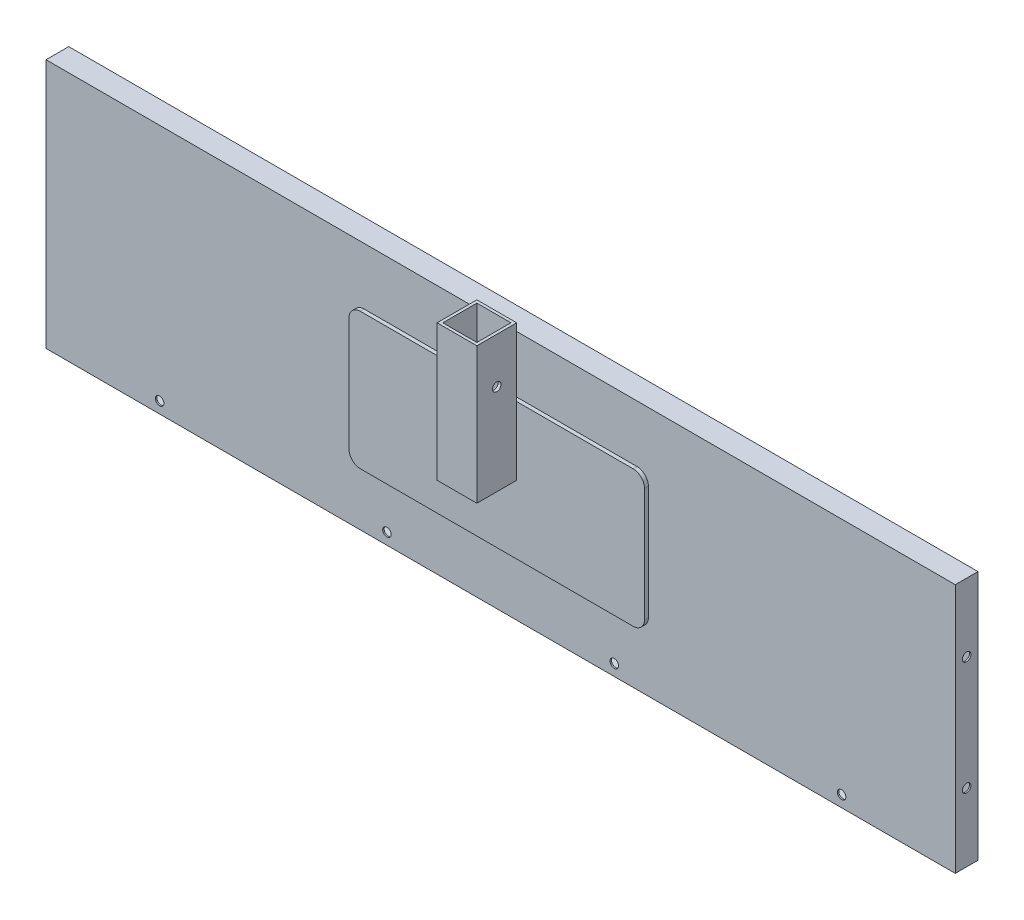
ISO-10303-21;
HEADER;
FILE_DESCRIPTION(('STEP AP214'),'2;1');
FILE_NAME('part.step','',(''),(''),'','','');
FILE_SCHEMA(('AUTOMOTIVE_DESIGN { 1 0 10303 214 1 1 1 1 }'));
ENDSEC;
DATA;
#1=APPLICATION_CONTEXT('core data for automotive mechanical design processes');
#2=APPLICATION_PROTOCOL_DEFINITION('international standard','automotive_design',2000,#1);
#3=PRODUCT_CONTEXT('',#1,'mechanical');
#4=PRODUCT('Part','Part','',(#3));
#5=PRODUCT_RELATED_PRODUCT_CATEGORY('part','',(#4));
#6=PRODUCT_DEFINITION_FORMATION('','',#4);
#7=PRODUCT_DEFINITION_CONTEXT('part definition',#1,'design');
#8=PRODUCT_DEFINITION('design','',#6,#7);
#9=PRODUCT_DEFINITION_SHAPE('','',#8);
#10=(LENGTH_UNIT() NAMED_UNIT(*) SI_UNIT(.MILLI.,.METRE.));
#11=(NAMED_UNIT(*) PLANE_ANGLE_UNIT() SI_UNIT($,.RADIAN.));
#12=(NAMED_UNIT(*) SI_UNIT($,.STERADIAN.) SOLID_ANGLE_UNIT());
#13=UNCERTAINTY_MEASURE_WITH_UNIT(LENGTH_MEASURE(1.E-05),#10,'distance_accuracy_value','');
#14=(GEOMETRIC_REPRESENTATION_CONTEXT(3) GLOBAL_UNCERTAINTY_ASSIGNED_CONTEXT((#13)) GLOBAL_UNIT_ASSIGNED_CONTEXT((#10,
#11,#12)) REPRESENTATION_CONTEXT('',''));
#15=CARTESIAN_POINT('',(0.,0.,0.));
#16=DIRECTION('',(0.,0.,1.));
#17=DIRECTION('',(1.,0.,0.));
#18=AXIS2_PLACEMENT_3D('',#15,#16,#17);
#19=CARTESIAN_POINT('',(508.,-139.7,25.4));
#20=DIRECTION('',(-1.,0.,0.));
#21=DIRECTION('',(0.,0.,1.));
#22=AXIS2_PLACEMENT_3D('',#19,#20,#21);
#23=PLANE('',#22);
#24=CARTESIAN_POINT('',(508.,63.4999999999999,12.7));
#25=DIRECTION('',(1.,0.,0.));
#26=DIRECTION('',(0.,0.,-1.));
#27=AXIS2_PLACEMENT_3D('',#24,#25,#26);
#28=CIRCLE('',#27,4.76249999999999);
#29=CARTESIAN_POINT('',(508.,63.4999999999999,7.93750000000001));
#30=VERTEX_POINT('',#29);
#31=EDGE_CURVE('E1524',#30,#30,#28,.T.);
#32=ORIENTED_EDGE('',*,*,#31,.F.);
#33=EDGE_LOOP('',(#32));
#34=FACE_BOUND('',#33,.T.);
#35=DIRECTION('',(0.,1.,0.));
#36=VECTOR('',#35,1.);
#37=CARTESIAN_POINT('',(508.,-139.7,0.));
#38=LINE('',#37,#36);
#39=CARTESIAN_POINT('',(508.,-139.7,0.));
#40=VERTEX_POINT('',#39);
#41=CARTESIAN_POINT('',(508.,139.7,0.));
#42=VERTEX_POINT('',#41);
#43=EDGE_CURVE('E568',#40,#42,#38,.T.);
#44=ORIENTED_EDGE('',*,*,#43,.T.);
#45=DIRECTION('',(0.,0.,-1.));
#46=VECTOR('',#45,1.);
#47=CARTESIAN_POINT('',(508.,139.7,25.4));
#48=LINE('',#47,#46);
#49=CARTESIAN_POINT('',(508.,139.7,25.4));
#50=VERTEX_POINT('',#49);
#51=EDGE_CURVE('E559',#50,#42,#48,.T.);
#52=ORIENTED_EDGE('',*,*,#51,.F.);
#53=DIRECTION('',(0.,1.,0.));
#54=VECTOR('',#53,1.);
#55=CARTESIAN_POINT('',(508.,-139.7,25.4));
#56=LINE('',#55,#54);
#57=CARTESIAN_POINT('',(508.,-139.7,25.4));
#58=VERTEX_POINT('',#57);
#59=EDGE_CURVE('E578',#58,#50,#56,.T.);
#60=ORIENTED_EDGE('',*,*,#59,.F.);
#61=DIRECTION('',(0.,0.,-1.));
#62=VECTOR('',#61,1.);
#63=CARTESIAN_POINT('',(508.,-139.7,25.4));
#64=LINE('',#63,#62);
#65=EDGE_CURVE('E556',#58,#40,#64,.T.);
#66=ORIENTED_EDGE('',*,*,#65,.T.);
#67=EDGE_LOOP('',(#44,#52,#60,#66));
#68=FACE_BOUND('',#67,.T.);
#69=CARTESIAN_POINT('',(508.,-63.5,12.7));
#70=DIRECTION('',(1.,0.,0.));
#71=DIRECTION('',(0.,0.,-1.));
#72=AXIS2_PLACEMENT_3D('',#69,#70,#71);
#73=CIRCLE('',#72,4.76249999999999);
#74=CARTESIAN_POINT('',(508.,-63.5,7.93750000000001));
#75=VERTEX_POINT('',#74);
#76=EDGE_CURVE('E1521',#75,#75,#73,.T.);
#77=ORIENTED_EDGE('',*,*,#76,.F.);
#78=EDGE_LOOP('',(#77));
#79=FACE_BOUND('',#78,.T.);
#80=ADVANCED_FACE('F39',(#34,#68,#79),#23,.F.);
#81=CARTESIAN_POINT('',(-482.6,-114.3,25.4));
#82=DIRECTION('',(1.,0.,0.));
#83=DIRECTION('',(0.,0.,-1.));
#84=AXIS2_PLACEMENT_3D('',#81,#82,#83);
#85=PLANE('',#84);
#86=CARTESIAN_POINT('',(-482.6,-63.5,12.7));
#87=DIRECTION('',(1.,0.,0.));
#88=DIRECTION('',(0.,0.,-1.));
#89=AXIS2_PLACEMENT_3D('',#86,#87,#88);
#90=CIRCLE('',#89,4.76249999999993);
#91=CARTESIAN_POINT('',(-482.6,-63.5,7.93750000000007));
#92=VERTEX_POINT('',#91);
#93=EDGE_CURVE('E1554',#92,#92,#90,.F.);
#94=ORIENTED_EDGE('',*,*,#93,.T.);
#95=EDGE_LOOP('',(#94));
#96=FACE_BOUND('',#95,.T.);
#97=DIRECTION('',(0.,0.,-1.));
#98=VECTOR('',#97,1.);
#99=CARTESIAN_POINT('',(-482.6,114.3,25.4));
#100=LINE('',#99,#98);
#101=CARTESIAN_POINT('',(-482.6,114.3,21.082));
#102=VERTEX_POINT('',#101);
#103=CARTESIAN_POINT('',(-482.6,114.3,3.175));
#104=VERTEX_POINT('',#103);
#105=EDGE_CURVE('E693',#102,#104,#100,.T.);
#106=ORIENTED_EDGE('',*,*,#105,.F.);
#107=DIRECTION('',(0.,-1.,0.));
#108=VECTOR('',#107,1.);
#109=CARTESIAN_POINT('',(-482.6,114.3,21.082));
#110=LINE('',#109,#108);
#111=CARTESIAN_POINT('',(-482.6,-114.3,21.082));
#112=VERTEX_POINT('',#111);
#113=EDGE_CURVE('E466',#102,#112,#110,.T.);
#114=ORIENTED_EDGE('',*,*,#113,.T.);
#115=DIRECTION('',(0.,0.,-1.));
#116=VECTOR('',#115,1.);
#117=CARTESIAN_POINT('',(-482.6,-114.3,25.4));
#118=LINE('',#117,#116);
#119=CARTESIAN_POINT('',(-482.6,-114.3,3.175));
#120=VERTEX_POINT('',#119);
#121=EDGE_CURVE('E576',#112,#120,#118,.T.);
#122=ORIENTED_EDGE('',*,*,#121,.T.);
#123=DIRECTION('',(0.,-1.,0.));
#124=VECTOR('',#123,1.);
#125=CARTESIAN_POINT('',(-482.6,1.36842577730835E-12,3.175));
#126=LINE('',#125,#124);
#127=CARTESIAN_POINT('',(-482.6,-94.7229925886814,3.175));
#128=VERTEX_POINT('',#127);
#129=EDGE_CURVE('E680',#128,#120,#126,.T.);
#130=ORIENTED_EDGE('',*,*,#129,.F.);
#131=DIRECTION('',(0.,0.,-1.));
#132=VECTOR('',#131,1.);
#133=CARTESIAN_POINT('',(-482.6,-94.7229925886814,3.175));
#134=LINE('',#133,#132);
#135=CARTESIAN_POINT('',(-482.6,-94.7229925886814,0.));
#136=VERTEX_POINT('',#135);
#137=EDGE_CURVE('E722',#128,#136,#134,.T.);
#138=ORIENTED_EDGE('',*,*,#137,.T.);
#139=DIRECTION('',(0.,-1.,0.));
#140=VECTOR('',#139,1.);
#141=CARTESIAN_POINT('',(-482.6,-114.3,0.));
#142=LINE('',#141,#140);
#143=CARTESIAN_POINT('',(-482.6,94.7229925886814,0.));
#144=VERTEX_POINT('',#143);
#145=EDGE_CURVE('E586',#144,#136,#142,.T.);
#146=ORIENTED_EDGE('',*,*,#145,.F.);
#147=DIRECTION('',(0.,0.,-1.));
#148=VECTOR('',#147,1.);
#149=CARTESIAN_POINT('',(-482.6,94.7229925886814,3.175));
#150=LINE('',#149,#148);
#151=CARTESIAN_POINT('',(-482.6,94.7229925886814,3.175));
#152=VERTEX_POINT('',#151);
#153=EDGE_CURVE('E675',#152,#144,#150,.T.);
#154=ORIENTED_EDGE('',*,*,#153,.F.);
#155=DIRECTION('',(0.,-1.,0.));
#156=VECTOR('',#155,1.);
#157=CARTESIAN_POINT('',(-482.6,0.,3.175));
#158=LINE('',#157,#156);
#159=EDGE_CURVE('E672',#104,#152,#158,.T.);
#160=ORIENTED_EDGE('',*,*,#159,.F.);
#161=EDGE_LOOP('',(#106,#114,#122,#130,#138,#146,#154,#160));
#162=FACE_BOUND('',#161,.T.);
#163=CARTESIAN_POINT('',(-482.6,63.4999999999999,12.7));
#164=DIRECTION('',(1.,0.,0.));
#165=DIRECTION('',(0.,0.,-1.));
#166=AXIS2_PLACEMENT_3D('',#163,#164,#165);
#167=CIRCLE('',#166,4.76249999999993);
#168=CARTESIAN_POINT('',(-482.6,63.4999999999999,7.93750000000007));
#169=VERTEX_POINT('',#168);
#170=EDGE_CURVE('E1542',#169,#169,#167,.F.);
#171=ORIENTED_EDGE('',*,*,#170,.T.);
#172=EDGE_LOOP('',(#171));
#173=FACE_BOUND('',#172,.T.);
#174=ADVANCED_FACE('F710',(#96,#162,#173),#85,.T.);
#175=CARTESIAN_POINT('',(0.,0.,25.4));
#176=DIRECTION('',(0.,0.,1.));
#177=DIRECTION('',(1.,0.,0.));
#178=AXIS2_PLACEMENT_3D('',#175,#176,#177);
#179=PLANE('',#178);
#180=CARTESIAN_POINT('',(-127.,-127.,25.4));
#181=DIRECTION('',(0.,0.,-1.));
#182=DIRECTION('',(-1.,0.,0.));
#183=AXIS2_PLACEMENT_3D('',#180,#181,#182);
#184=CIRCLE('',#183,4.76249999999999);
#185=CARTESIAN_POINT('',(-131.7625,-127.,25.4));
#186=VERTEX_POINT('',#185);
#187=EDGE_CURVE('E481',#186,#186,#184,.T.);
#188=ORIENTED_EDGE('',*,*,#187,.T.);
#189=EDGE_LOOP('',(#188));
#190=FACE_BOUND('',#189,.T.);
#191=CARTESIAN_POINT('',(381.,-127.,25.4));
#192=DIRECTION('',(0.,0.,-1.));
#193=DIRECTION('',(-1.,0.,0.));
#194=AXIS2_PLACEMENT_3D('',#191,#192,#193);
#195=CIRCLE('',#194,4.7625);
#196=CARTESIAN_POINT('',(376.2375,-127.,25.4));
#197=VERTEX_POINT('',#196);
#198=EDGE_CURVE('E486',#197,#197,#195,.T.);
#199=ORIENTED_EDGE('',*,*,#198,.T.);
#200=EDGE_LOOP('',(#199));
#201=FACE_BOUND('',#200,.T.);
#202=CARTESIAN_POINT('',(127.,-127.,25.4));
#203=DIRECTION('',(0.,0.,-1.));
#204=DIRECTION('',(-1.,0.,0.));
#205=AXIS2_PLACEMENT_3D('',#202,#203,#204);
#206=CIRCLE('',#205,4.7625);
#207=CARTESIAN_POINT('',(122.2375,-127.,25.4));
#208=VERTEX_POINT('',#207);
#209=EDGE_CURVE('E491',#208,#208,#206,.T.);
#210=ORIENTED_EDGE('',*,*,#209,.T.);
#211=EDGE_LOOP('',(#210));
#212=FACE_BOUND('',#211,.T.);
#213=DIRECTION('',(0.,-1.,0.));
#214=VECTOR('',#213,1.);
#215=CARTESIAN_POINT('',(-508.,-139.7,25.4));
#216=LINE('',#215,#214);
#217=CARTESIAN_POINT('',(-508.,139.7,25.4));
#218=VERTEX_POINT('',#217);
#219=CARTESIAN_POINT('',(-508.,-139.7,25.4));
#220=VERTEX_POINT('',#219);
#221=EDGE_CURVE('E569',#218,#220,#216,.T.);
#222=ORIENTED_EDGE('',*,*,#221,.T.);
#223=DIRECTION('',(1.,0.,0.));
#224=VECTOR('',#223,1.);
#225=CARTESIAN_POINT('',(508.,-139.7,25.4));
#226=LINE('',#225,#224);
#227=EDGE_CURVE('E580',#220,#58,#226,.T.);
#228=ORIENTED_EDGE('',*,*,#227,.T.);
#229=ORIENTED_EDGE('',*,*,#59,.T.);
#230=DIRECTION('',(-1.,0.,0.));
#231=VECTOR('',#230,1.);
#232=CARTESIAN_POINT('',(508.,139.7,25.4));
#233=LINE('',#232,#231);
#234=EDGE_CURVE('E565',#50,#218,#233,.T.);
#235=ORIENTED_EDGE('',*,*,#234,.T.);
#236=EDGE_LOOP('',(#222,#228,#229,#235));
#237=FACE_BOUND('',#236,.T.);
#238=CARTESIAN_POINT('',(-381.,-127.,25.4));
#239=DIRECTION('',(0.,0.,-1.));
#240=DIRECTION('',(-1.,0.,0.));
#241=AXIS2_PLACEMENT_3D('',#238,#239,#240);
#242=CIRCLE('',#241,4.7625);
#243=CARTESIAN_POINT('',(-385.7625,-127.,25.4));
#244=VERTEX_POINT('',#243);
#245=EDGE_CURVE('E476',#244,#244,#242,.T.);
#246=ORIENTED_EDGE('',*,*,#245,.T.);
#247=EDGE_LOOP('',(#246));
#248=FACE_BOUND('',#247,.T.);
#249=DIRECTION('',(-1.,0.,0.));
#250=VECTOR('',#249,1.);
#251=CARTESIAN_POINT('',(152.4,76.2,25.4));
#252=LINE('',#251,#250);
#253=CARTESIAN_POINT('',(152.4,76.2,25.4));
#254=VERTEX_POINT('',#253);
#255=CARTESIAN_POINT('',(-152.4,76.2,25.4));
#256=VERTEX_POINT('',#255);
#257=EDGE_CURVE('E427',#254,#256,#252,.T.);
#258=ORIENTED_EDGE('',*,*,#257,.F.);
#259=CARTESIAN_POINT('',(152.4,63.5,25.4));
#260=DIRECTION('',(0.,0.,1.));
#261=DIRECTION('',(1.,0.,0.));
#262=AXIS2_PLACEMENT_3D('',#259,#260,#261);
#263=CIRCLE('',#262,12.7);
#264=CARTESIAN_POINT('',(165.1,63.4999999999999,25.4));
#265=VERTEX_POINT('',#264);
#266=EDGE_CURVE('E402',#265,#254,#263,.T.);
#267=ORIENTED_EDGE('',*,*,#266,.F.);
#268=DIRECTION('',(0.,1.,0.));
#269=VECTOR('',#268,1.);
#270=CARTESIAN_POINT('',(165.1,-63.4999999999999,25.4));
#271=LINE('',#270,#269);
#272=CARTESIAN_POINT('',(165.1,-63.4999999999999,25.4));
#273=VERTEX_POINT('',#272);
#274=EDGE_CURVE('E407',#273,#265,#271,.T.);
#275=ORIENTED_EDGE('',*,*,#274,.F.);
#276=CARTESIAN_POINT('',(152.4,-63.5,25.4));
#277=DIRECTION('',(0.,0.,1.));
#278=DIRECTION('',(1.,0.,0.));
#279=AXIS2_PLACEMENT_3D('',#276,#277,#278);
#280=CIRCLE('',#279,12.7);
#281=CARTESIAN_POINT('',(152.4,-76.2,25.4));
#282=VERTEX_POINT('',#281);
#283=EDGE_CURVE('E437',#282,#273,#280,.T.);
#284=ORIENTED_EDGE('',*,*,#283,.F.);
#285=DIRECTION('',(1.,0.,0.));
#286=VECTOR('',#285,1.);
#287=CARTESIAN_POINT('',(152.4,-76.2,25.4));
#288=LINE('',#287,#286);
#289=CARTESIAN_POINT('',(-152.4,-76.2,25.4));
#290=VERTEX_POINT('',#289);
#291=EDGE_CURVE('E435',#290,#282,#288,.T.);
#292=ORIENTED_EDGE('',*,*,#291,.F.);
#293=CARTESIAN_POINT('',(-152.4,-63.5,25.4));
#294=DIRECTION('',(0.,0.,1.));
#295=DIRECTION('',(-1.,0.,0.));
#296=AXIS2_PLACEMENT_3D('',#293,#294,#295);
#297=CIRCLE('',#296,12.7);
#298=CARTESIAN_POINT('',(-165.1,-63.4999999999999,25.4));
#299=VERTEX_POINT('',#298);
#300=EDGE_CURVE('E433',#299,#290,#297,.T.);
#301=ORIENTED_EDGE('',*,*,#300,.F.);
#302=DIRECTION('',(0.,-1.,0.));
#303=VECTOR('',#302,1.);
#304=CARTESIAN_POINT('',(-165.1,-63.4999999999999,25.4));
#305=LINE('',#304,#303);
#306=CARTESIAN_POINT('',(-165.1,63.4999999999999,25.4));
#307=VERTEX_POINT('',#306);
#308=EDGE_CURVE('E431',#307,#299,#305,.T.);
#309=ORIENTED_EDGE('',*,*,#308,.F.);
#310=CARTESIAN_POINT('',(-152.4,63.5,25.4));
#311=DIRECTION('',(0.,0.,1.));
#312=DIRECTION('',(1.,0.,0.));
#313=AXIS2_PLACEMENT_3D('',#310,#311,#312);
#314=CIRCLE('',#313,12.7);
#315=EDGE_CURVE('E429',#256,#307,#314,.T.);
#316=ORIENTED_EDGE('',*,*,#315,.F.);
#317=EDGE_LOOP('',(#258,#267,#275,#284,#292,#301,#309,#316));
#318=FACE_BOUND('',#317,.T.);
#319=ADVANCED_FACE('F863',(#190,#201,#212,#237,#248,#318),#179,.T.);
#320=CARTESIAN_POINT('',(482.6,-114.3,25.4));
#321=DIRECTION('',(0.,1.,0.));
#322=DIRECTION('',(-1.,0.,0.));
#323=AXIS2_PLACEMENT_3D('',#320,#321,#322);
#324=PLANE('',#323);
#325=ORIENTED_EDGE('',*,*,#121,.F.);
#326=DIRECTION('',(1.,0.,0.));
#327=VECTOR('',#326,1.);
#328=CARTESIAN_POINT('',(-482.6,-114.3,21.082));
#329=LINE('',#328,#327);
#330=CARTESIAN_POINT('',(482.6,-114.3,21.082));
#331=VERTEX_POINT('',#330);
#332=EDGE_CURVE('E469',#112,#331,#329,.T.);
#333=ORIENTED_EDGE('',*,*,#332,.T.);
#334=DIRECTION('',(0.,0.,-1.));
#335=VECTOR('',#334,1.);
#336=CARTESIAN_POINT('',(482.6,-114.3,25.4));
#337=LINE('',#336,#335);
#338=CARTESIAN_POINT('',(482.6,-114.3,3.175));
#339=VERTEX_POINT('',#338);
#340=EDGE_CURVE('E694',#331,#339,#337,.T.);
#341=ORIENTED_EDGE('',*,*,#340,.T.);
#342=DIRECTION('',(-1.,0.,0.));
#343=VECTOR('',#342,1.);
#344=CARTESIAN_POINT('',(0.,-114.3,3.175));
#345=LINE('',#344,#343);
#346=CARTESIAN_POINT('',(399.941524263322,-114.3,3.175));
#347=VERTEX_POINT('',#346);
#348=EDGE_CURVE('E744',#339,#347,#345,.T.);
#349=ORIENTED_EDGE('',*,*,#348,.T.);
#350=DIRECTION('',(0.,0.,-1.));
#351=VECTOR('',#350,1.);
#352=CARTESIAN_POINT('',(399.941524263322,-114.3,3.175));
#353=LINE('',#352,#351);
#354=CARTESIAN_POINT('',(399.941524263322,-114.3,0.));
#355=VERTEX_POINT('',#354);
#356=EDGE_CURVE('E748',#347,#355,#353,.T.);
#357=ORIENTED_EDGE('',*,*,#356,.T.);
#358=DIRECTION('',(1.,0.,0.));
#359=VECTOR('',#358,1.);
#360=CARTESIAN_POINT('',(482.6,-114.3,0.));
#361=LINE('',#360,#359);
#362=CARTESIAN_POINT('',(-399.941524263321,-114.3,0.));
#363=VERTEX_POINT('',#362);
#364=EDGE_CURVE('E622',#363,#355,#361,.T.);
#365=ORIENTED_EDGE('',*,*,#364,.F.);
#366=DIRECTION('',(0.,0.,-1.));
#367=VECTOR('',#366,1.);
#368=CARTESIAN_POINT('',(-399.941524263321,-114.3,3.175));
#369=LINE('',#368,#367);
#370=CARTESIAN_POINT('',(-399.941524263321,-114.3,3.175));
#371=VERTEX_POINT('',#370);
#372=EDGE_CURVE('E676',#371,#363,#369,.T.);
#373=ORIENTED_EDGE('',*,*,#372,.F.);
#374=DIRECTION('',(1.,0.,0.));
#375=VECTOR('',#374,1.);
#376=CARTESIAN_POINT('',(1.53521451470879E-13,-114.299999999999,3.175));
#377=LINE('',#376,#375);
#378=EDGE_CURVE('E718',#120,#371,#377,.T.);
#379=ORIENTED_EDGE('',*,*,#378,.F.);
#380=EDGE_LOOP('',(#325,#333,#341,#349,#357,#365,#373,#379));
#381=FACE_BOUND('',#380,.T.);
#382=ADVANCED_FACE('F724',(#381),#324,.T.);
#383=CARTESIAN_POINT('',(482.6,-114.3,25.4));
#384=DIRECTION('',(-1.,0.,0.));
#385=DIRECTION('',(0.,0.,1.));
#386=AXIS2_PLACEMENT_3D('',#383,#384,#385);
#387=PLANE('',#386);
#388=CARTESIAN_POINT('',(482.6,63.4999999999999,12.7));
#389=DIRECTION('',(-1.,0.,0.));
#390=DIRECTION('',(0.,0.,1.));
#391=AXIS2_PLACEMENT_3D('',#388,#389,#390);
#392=CIRCLE('',#391,4.76249999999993);
#393=CARTESIAN_POINT('',(482.6,63.4999999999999,17.4624999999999));
#394=VERTEX_POINT('',#393);
#395=EDGE_CURVE('E1515',#394,#394,#392,.T.);
#396=ORIENTED_EDGE('',*,*,#395,.F.);
#397=EDGE_LOOP('',(#396));
#398=FACE_BOUND('',#397,.T.);
#399=CARTESIAN_POINT('',(482.6,-63.5,12.7));
#400=DIRECTION('',(-1.,0.,0.));
#401=DIRECTION('',(0.,0.,1.));
#402=AXIS2_PLACEMENT_3D('',#399,#400,#401);
#403=CIRCLE('',#402,4.76249999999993);
#404=CARTESIAN_POINT('',(482.6,-63.5,17.4624999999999));
#405=VERTEX_POINT('',#404);
#406=EDGE_CURVE('E1530',#405,#405,#403,.T.);
#407=ORIENTED_EDGE('',*,*,#406,.F.);
#408=EDGE_LOOP('',(#407));
#409=FACE_BOUND('',#408,.T.);
#410=ORIENTED_EDGE('',*,*,#340,.F.);
#411=DIRECTION('',(0.,1.,0.));
#412=VECTOR('',#411,1.);
#413=CARTESIAN_POINT('',(482.6,-114.3,21.082));
#414=LINE('',#413,#412);
#415=CARTESIAN_POINT('',(482.6,114.3,21.082));
#416=VERTEX_POINT('',#415);
#417=EDGE_CURVE('E460',#331,#416,#414,.T.);
#418=ORIENTED_EDGE('',*,*,#417,.T.);
#419=DIRECTION('',(0.,0.,-1.));
#420=VECTOR('',#419,1.);
#421=CARTESIAN_POINT('',(482.6,114.3,25.4));
#422=LINE('',#421,#420);
#423=CARTESIAN_POINT('',(482.6,114.3,3.175));
#424=VERTEX_POINT('',#423);
#425=EDGE_CURVE('E690',#416,#424,#422,.T.);
#426=ORIENTED_EDGE('',*,*,#425,.T.);
#427=DIRECTION('',(0.,-1.,0.));
#428=VECTOR('',#427,1.);
#429=CARTESIAN_POINT('',(482.6,0.,3.175));
#430=LINE('',#429,#428);
#431=CARTESIAN_POINT('',(482.6,94.7229925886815,3.175));
#432=VERTEX_POINT('',#431);
#433=EDGE_CURVE('E646',#424,#432,#430,.T.);
#434=ORIENTED_EDGE('',*,*,#433,.T.);
#435=DIRECTION('',(0.,0.,-1.));
#436=VECTOR('',#435,1.);
#437=CARTESIAN_POINT('',(482.6,94.7229925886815,3.175));
#438=LINE('',#437,#436);
#439=CARTESIAN_POINT('',(482.6,94.7229925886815,0.));
#440=VERTEX_POINT('',#439);
#441=EDGE_CURVE('E641',#432,#440,#438,.T.);
#442=ORIENTED_EDGE('',*,*,#441,.T.);
#443=DIRECTION('',(0.,1.,0.));
#444=VECTOR('',#443,1.);
#445=CARTESIAN_POINT('',(482.6,-114.3,0.));
#446=LINE('',#445,#444);
#447=CARTESIAN_POINT('',(482.6,-94.7229925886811,0.));
#448=VERTEX_POINT('',#447);
#449=EDGE_CURVE('E822',#448,#440,#446,.T.);
#450=ORIENTED_EDGE('',*,*,#449,.F.);
#451=DIRECTION('',(0.,0.,-1.));
#452=VECTOR('',#451,1.);
#453=CARTESIAN_POINT('',(482.6,-94.7229925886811,3.175));
#454=LINE('',#453,#452);
#455=CARTESIAN_POINT('',(482.6,-94.7229925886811,3.175));
#456=VERTEX_POINT('',#455);
#457=EDGE_CURVE('E628',#456,#448,#454,.T.);
#458=ORIENTED_EDGE('',*,*,#457,.F.);
#459=DIRECTION('',(0.,-1.,0.));
#460=VECTOR('',#459,1.);
#461=CARTESIAN_POINT('',(482.6,0.,3.175));
#462=LINE('',#461,#460);
#463=EDGE_CURVE('E752',#456,#339,#462,.T.);
#464=ORIENTED_EDGE('',*,*,#463,.T.);
#465=EDGE_LOOP('',(#410,#418,#426,#434,#442,#450,#458,#464));
#466=FACE_BOUND('',#465,.T.);
#467=ADVANCED_FACE('F828',(#398,#409,#466),#387,.T.);
#468=CARTESIAN_POINT('',(482.6,114.3,25.4));
#469=DIRECTION('',(0.,-1.,0.));
#470=DIRECTION('',(1.,0.,0.));
#471=AXIS2_PLACEMENT_3D('',#468,#469,#470);
#472=PLANE('',#471);
#473=ORIENTED_EDGE('',*,*,#425,.F.);
#474=DIRECTION('',(-1.,0.,0.));
#475=VECTOR('',#474,1.);
#476=CARTESIAN_POINT('',(482.6,114.3,21.082));
#477=LINE('',#476,#475);
#478=EDGE_CURVE('E463',#416,#102,#477,.T.);
#479=ORIENTED_EDGE('',*,*,#478,.T.);
#480=ORIENTED_EDGE('',*,*,#105,.T.);
#481=DIRECTION('',(1.,0.,0.));
#482=VECTOR('',#481,1.);
#483=CARTESIAN_POINT('',(-1.53521451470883E-13,114.300000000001,3.175));
#484=LINE('',#483,#482);
#485=CARTESIAN_POINT('',(-399.941524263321,114.3,3.175));
#486=VERTEX_POINT('',#485);
#487=EDGE_CURVE('E652',#104,#486,#484,.T.);
#488=ORIENTED_EDGE('',*,*,#487,.T.);
#489=DIRECTION('',(0.,0.,-1.));
#490=VECTOR('',#489,1.);
#491=CARTESIAN_POINT('',(-399.941524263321,114.3,3.175));
#492=LINE('',#491,#490);
#493=CARTESIAN_POINT('',(-399.941524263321,114.3,0.));
#494=VERTEX_POINT('',#493);
#495=EDGE_CURVE('E687',#486,#494,#492,.T.);
#496=ORIENTED_EDGE('',*,*,#495,.T.);
#497=DIRECTION('',(-1.,0.,0.));
#498=VECTOR('',#497,1.);
#499=CARTESIAN_POINT('',(482.6,114.3,0.));
#500=LINE('',#499,#498);
#501=CARTESIAN_POINT('',(399.941524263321,114.3,0.));
#502=VERTEX_POINT('',#501);
#503=EDGE_CURVE('E830',#502,#494,#500,.T.);
#504=ORIENTED_EDGE('',*,*,#503,.F.);
#505=DIRECTION('',(0.,0.,-1.));
#506=VECTOR('',#505,1.);
#507=CARTESIAN_POINT('',(399.941524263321,114.3,3.175));
#508=LINE('',#507,#506);
#509=CARTESIAN_POINT('',(399.941524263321,114.3,3.175));
#510=VERTEX_POINT('',#509);
#511=EDGE_CURVE('E624',#510,#502,#508,.T.);
#512=ORIENTED_EDGE('',*,*,#511,.F.);
#513=DIRECTION('',(1.,0.,0.));
#514=VECTOR('',#513,1.);
#515=CARTESIAN_POINT('',(0.,114.3,3.175));
#516=LINE('',#515,#514);
#517=EDGE_CURVE('E645',#510,#424,#516,.T.);
#518=ORIENTED_EDGE('',*,*,#517,.T.);
#519=EDGE_LOOP('',(#473,#479,#480,#488,#496,#504,#512,#518));
#520=FACE_BOUND('',#519,.T.);
#521=ADVANCED_FACE('F839',(#520),#472,.T.);
#522=CARTESIAN_POINT('',(0.,0.,3.175));
#523=DIRECTION('',(0.,0.,1.));
#524=DIRECTION('',(1.,0.,0.));
#525=AXIS2_PLACEMENT_3D('',#522,#523,#524);
#526=PLANE('',#525);
#527=ORIENTED_EDGE('',*,*,#129,.T.);
#528=ORIENTED_EDGE('',*,*,#378,.T.);
#529=DIRECTION('',(0.97308028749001,0.230466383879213,0.));
#530=VECTOR('',#529,1.);
#531=CARTESIAN_POINT('',(4.390384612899,-18.5371794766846,3.175));
#532=LINE('',#531,#530);
#533=CARTESIAN_POINT('',(1.9819215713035E-13,-19.5770074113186,3.175));
#534=VERTEX_POINT('',#533);
#535=EDGE_CURVE('E732',#371,#534,#532,.T.);
#536=ORIENTED_EDGE('',*,*,#535,.T.);
#537=DIRECTION('',(0.97308028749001,-0.230466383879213,0.));
#538=VECTOR('',#537,1.);
#539=CARTESIAN_POINT('',(-4.39038461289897,-18.5371794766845,3.175));
#540=LINE('',#539,#538);
#541=EDGE_CURVE('E734',#534,#347,#540,.T.);
#542=ORIENTED_EDGE('',*,*,#541,.T.);
#543=ORIENTED_EDGE('',*,*,#348,.F.);
#544=ORIENTED_EDGE('',*,*,#463,.F.);
#545=DIRECTION('',(0.973080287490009,-0.230466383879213,0.));
#546=VECTOR('',#545,1.);
#547=CARTESIAN_POINT('',(4.39038461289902,18.5371794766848,3.175));
#548=LINE('',#547,#546);
#549=CARTESIAN_POINT('',(82.6584757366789,1.00613961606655E-13,3.175));
#550=VERTEX_POINT('',#549);
#551=EDGE_CURVE('E738',#550,#456,#548,.T.);
#552=ORIENTED_EDGE('',*,*,#551,.F.);
#553=DIRECTION('',(0.97308028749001,0.230466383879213,0.));
#554=VECTOR('',#553,1.);
#555=CARTESIAN_POINT('',(4.390384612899,-18.5371794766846,3.175));
#556=LINE('',#555,#554);
#557=EDGE_CURVE('E663',#550,#432,#556,.T.);
#558=ORIENTED_EDGE('',*,*,#557,.T.);
#559=ORIENTED_EDGE('',*,*,#433,.F.);
#560=ORIENTED_EDGE('',*,*,#517,.F.);
#561=DIRECTION('',(0.97308028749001,0.230466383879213,0.));
#562=VECTOR('',#561,1.);
#563=CARTESIAN_POINT('',(-4.39038461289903,18.5371794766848,3.175));
#564=LINE('',#563,#562);
#565=CARTESIAN_POINT('',(0.,19.5770074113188,3.175));
#566=VERTEX_POINT('',#565);
#567=EDGE_CURVE('E659',#566,#510,#564,.T.);
#568=ORIENTED_EDGE('',*,*,#567,.F.);
#569=DIRECTION('',(0.973080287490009,-0.230466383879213,0.));
#570=VECTOR('',#569,1.);
#571=CARTESIAN_POINT('',(4.39038461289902,18.5371794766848,3.175));
#572=LINE('',#571,#570);
#573=EDGE_CURVE('E662',#486,#566,#572,.T.);
#574=ORIENTED_EDGE('',*,*,#573,.F.);
#575=ORIENTED_EDGE('',*,*,#487,.F.);
#576=ORIENTED_EDGE('',*,*,#159,.T.);
#577=DIRECTION('',(0.97308028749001,-0.230466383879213,0.));
#578=VECTOR('',#577,1.);
#579=CARTESIAN_POINT('',(-4.39038461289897,-18.5371794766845,3.175));
#580=LINE('',#579,#578);
#581=CARTESIAN_POINT('',(-82.6584757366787,0.,3.175));
#582=VERTEX_POINT('',#581);
#583=EDGE_CURVE('E665',#152,#582,#580,.T.);
#584=ORIENTED_EDGE('',*,*,#583,.T.);
#585=DIRECTION('',(0.97308028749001,0.230466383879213,0.));
#586=VECTOR('',#585,1.);
#587=CARTESIAN_POINT('',(-4.39038461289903,18.5371794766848,3.175));
#588=LINE('',#587,#586);
#589=EDGE_CURVE('E721',#128,#582,#588,.T.);
#590=ORIENTED_EDGE('',*,*,#589,.F.);
#591=EDGE_LOOP('',(#527,#528,#536,#542,#543,#544,#552,#558,#559,#560,#568,#574,#575,#576,#584,#590));
#592=FACE_BOUND('',#591,.T.);
#593=ADVANCED_FACE('F717',(#592),#526,.T.);
#594=CARTESIAN_POINT('',(4.390384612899,-18.5371794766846,3.175));
#595=DIRECTION('',(-0.230466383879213,0.973080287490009,0.));
#596=DIRECTION('',(-0.97308028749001,-0.230466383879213,0.));
#597=AXIS2_PLACEMENT_3D('',#594,#595,#596);
#598=PLANE('',#597);
#599=DIRECTION('',(0.97308028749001,0.230466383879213,0.));
#600=VECTOR('',#599,1.);
#601=CARTESIAN_POINT('',(4.390384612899,-18.5371794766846,0.));
#602=LINE('',#601,#600);
#603=CARTESIAN_POINT('',(1.9819215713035E-13,-19.5770074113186,0.));
#604=VERTEX_POINT('',#603);
#605=EDGE_CURVE('E613',#363,#604,#602,.T.);
#606=ORIENTED_EDGE('',*,*,#605,.T.);
#607=DIRECTION('',(0.,0.,-1.));
#608=VECTOR('',#607,1.);
#609=CARTESIAN_POINT('',(1.9819215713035E-13,-19.5770074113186,3.175));
#610=LINE('',#609,#608);
#611=EDGE_CURVE('E629',#534,#604,#610,.T.);
#612=ORIENTED_EDGE('',*,*,#611,.F.);
#613=ORIENTED_EDGE('',*,*,#535,.F.);
#614=ORIENTED_EDGE('',*,*,#372,.T.);
#615=EDGE_LOOP('',(#606,#612,#613,#614));
#616=FACE_BOUND('',#615,.T.);
#617=ADVANCED_FACE('F41',(#616),#598,.F.);
#618=CARTESIAN_POINT('',(-4.39038461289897,-18.5371794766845,3.175));
#619=DIRECTION('',(0.230466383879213,0.973080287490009,0.));
#620=DIRECTION('',(-0.97308028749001,0.230466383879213,0.));
#621=AXIS2_PLACEMENT_3D('',#618,#619,#620);
#622=PLANE('',#621);
#623=DIRECTION('',(0.97308028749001,-0.230466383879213,0.));
#624=VECTOR('',#623,1.);
#625=CARTESIAN_POINT('',(-4.39038461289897,-18.5371794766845,0.));
#626=LINE('',#625,#624);
#627=EDGE_CURVE('E775',#604,#355,#626,.T.);
#628=ORIENTED_EDGE('',*,*,#627,.T.);
#629=ORIENTED_EDGE('',*,*,#356,.F.);
#630=ORIENTED_EDGE('',*,*,#541,.F.);
#631=ORIENTED_EDGE('',*,*,#611,.T.);
#632=EDGE_LOOP('',(#628,#629,#630,#631));
#633=FACE_BOUND('',#632,.T.);
#634=ADVANCED_FACE('F847',(#633),#622,.F.);
#635=CARTESIAN_POINT('',(4.39038461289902,18.5371794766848,3.175));
#636=DIRECTION('',(0.230466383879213,0.973080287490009,0.));
#637=DIRECTION('',(-0.97308028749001,0.230466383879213,0.));
#638=AXIS2_PLACEMENT_3D('',#635,#636,#637);
#639=PLANE('',#638);
#640=DIRECTION('',(0.973080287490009,-0.230466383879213,0.));
#641=VECTOR('',#640,1.);
#642=CARTESIAN_POINT('',(4.39038461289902,18.5371794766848,0.));
#643=LINE('',#642,#641);
#644=CARTESIAN_POINT('',(82.6584757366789,1.00613961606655E-13,0.));
#645=VERTEX_POINT('',#644);
#646=EDGE_CURVE('E771',#645,#448,#643,.T.);
#647=ORIENTED_EDGE('',*,*,#646,.F.);
#648=DIRECTION('',(0.,0.,-1.));
#649=VECTOR('',#648,1.);
#650=CARTESIAN_POINT('',(82.6584757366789,1.00613961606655E-13,3.175));
#651=LINE('',#650,#649);
#652=EDGE_CURVE('E639',#550,#645,#651,.T.);
#653=ORIENTED_EDGE('',*,*,#652,.F.);
#654=ORIENTED_EDGE('',*,*,#551,.T.);
#655=ORIENTED_EDGE('',*,*,#457,.T.);
#656=EDGE_LOOP('',(#647,#653,#654,#655));
#657=FACE_BOUND('',#656,.T.);
#658=ADVANCED_FACE('F823',(#657),#639,.T.);
#659=CARTESIAN_POINT('',(4.390384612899,-18.5371794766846,3.175));
#660=DIRECTION('',(-0.230466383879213,0.973080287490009,0.));
#661=DIRECTION('',(-0.97308028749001,-0.230466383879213,0.));
#662=AXIS2_PLACEMENT_3D('',#659,#660,#661);
#663=PLANE('',#662);
#664=DIRECTION('',(0.97308028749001,0.230466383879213,0.));
#665=VECTOR('',#664,1.);
#666=CARTESIAN_POINT('',(4.390384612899,-18.5371794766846,0.));
#667=LINE('',#666,#665);
#668=EDGE_CURVE('E767',#645,#440,#667,.T.);
#669=ORIENTED_EDGE('',*,*,#668,.T.);
#670=ORIENTED_EDGE('',*,*,#441,.F.);
#671=ORIENTED_EDGE('',*,*,#557,.F.);
#672=ORIENTED_EDGE('',*,*,#652,.T.);
#673=EDGE_LOOP('',(#669,#670,#671,#672));
#674=FACE_BOUND('',#673,.T.);
#675=ADVANCED_FACE('F812',(#674),#663,.F.);
#676=CARTESIAN_POINT('',(-4.39038461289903,18.5371794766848,3.175));
#677=DIRECTION('',(-0.230466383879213,0.973080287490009,0.));
#678=DIRECTION('',(-0.97308028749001,-0.230466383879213,0.));
#679=AXIS2_PLACEMENT_3D('',#676,#677,#678);
#680=PLANE('',#679);
#681=DIRECTION('',(0.97308028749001,0.230466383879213,0.));
#682=VECTOR('',#681,1.);
#683=CARTESIAN_POINT('',(-4.39038461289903,18.5371794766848,0.));
#684=LINE('',#683,#682);
#685=CARTESIAN_POINT('',(0.,19.5770074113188,0.));
#686=VERTEX_POINT('',#685);
#687=EDGE_CURVE('E763',#686,#502,#684,.T.);
#688=ORIENTED_EDGE('',*,*,#687,.F.);
#689=DIRECTION('',(0.,0.,-1.));
#690=VECTOR('',#689,1.);
#691=CARTESIAN_POINT('',(0.,19.5770074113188,3.175));
#692=LINE('',#691,#690);
#693=EDGE_CURVE('E635',#566,#686,#692,.T.);
#694=ORIENTED_EDGE('',*,*,#693,.F.);
#695=ORIENTED_EDGE('',*,*,#567,.T.);
#696=ORIENTED_EDGE('',*,*,#511,.T.);
#697=EDGE_LOOP('',(#688,#694,#695,#696));
#698=FACE_BOUND('',#697,.T.);
#699=ADVANCED_FACE('F917',(#698),#680,.T.);
#700=CARTESIAN_POINT('',(4.39038461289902,18.5371794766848,3.175));
#701=DIRECTION('',(0.230466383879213,0.973080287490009,0.));
#702=DIRECTION('',(-0.97308028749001,0.230466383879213,0.));
#703=AXIS2_PLACEMENT_3D('',#700,#701,#702);
#704=PLANE('',#703);
#705=DIRECTION('',(0.973080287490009,-0.230466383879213,0.));
#706=VECTOR('',#705,1.);
#707=CARTESIAN_POINT('',(4.39038461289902,18.5371794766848,0.));
#708=LINE('',#707,#706);
#709=EDGE_CURVE('E759',#494,#686,#708,.T.);
#710=ORIENTED_EDGE('',*,*,#709,.F.);
#711=ORIENTED_EDGE('',*,*,#495,.F.);
#712=ORIENTED_EDGE('',*,*,#573,.T.);
#713=ORIENTED_EDGE('',*,*,#693,.T.);
#714=EDGE_LOOP('',(#710,#711,#712,#713));
#715=FACE_BOUND('',#714,.T.);
#716=ADVANCED_FACE('F914',(#715),#704,.T.);
#717=CARTESIAN_POINT('',(-4.39038461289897,-18.5371794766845,3.175));
#718=DIRECTION('',(0.230466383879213,0.973080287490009,0.));
#719=DIRECTION('',(-0.97308028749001,0.230466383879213,0.));
#720=AXIS2_PLACEMENT_3D('',#717,#718,#719);
#721=PLANE('',#720);
#722=DIRECTION('',(0.97308028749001,-0.230466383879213,0.));
#723=VECTOR('',#722,1.);
#724=CARTESIAN_POINT('',(-4.39038461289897,-18.5371794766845,0.));
#725=LINE('',#724,#723);
#726=CARTESIAN_POINT('',(-82.6584757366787,0.,0.));
#727=VERTEX_POINT('',#726);
#728=EDGE_CURVE('E762',#144,#727,#725,.T.);
#729=ORIENTED_EDGE('',*,*,#728,.T.);
#730=DIRECTION('',(0.,0.,-1.));
#731=VECTOR('',#730,1.);
#732=CARTESIAN_POINT('',(-82.6584757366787,0.,3.175));
#733=LINE('',#732,#731);
#734=EDGE_CURVE('E684',#582,#727,#733,.T.);
#735=ORIENTED_EDGE('',*,*,#734,.F.);
#736=ORIENTED_EDGE('',*,*,#583,.F.);
#737=ORIENTED_EDGE('',*,*,#153,.T.);
#738=EDGE_LOOP('',(#729,#735,#736,#737));
#739=FACE_BOUND('',#738,.T.);
#740=ADVANCED_FACE('F793',(#739),#721,.F.);
#741=CARTESIAN_POINT('',(-4.39038461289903,18.5371794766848,3.175));
#742=DIRECTION('',(-0.230466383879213,0.973080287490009,0.));
#743=DIRECTION('',(-0.97308028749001,-0.230466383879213,0.));
#744=AXIS2_PLACEMENT_3D('',#741,#742,#743);
#745=PLANE('',#744);
#746=DIRECTION('',(0.97308028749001,0.230466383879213,0.));
#747=VECTOR('',#746,1.);
#748=CARTESIAN_POINT('',(-4.39038461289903,18.5371794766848,0.));
#749=LINE('',#748,#747);
#750=EDGE_CURVE('E735',#136,#727,#749,.T.);
#751=ORIENTED_EDGE('',*,*,#750,.F.);
#752=ORIENTED_EDGE('',*,*,#137,.F.);
#753=ORIENTED_EDGE('',*,*,#589,.T.);
#754=ORIENTED_EDGE('',*,*,#734,.T.);
#755=EDGE_LOOP('',(#751,#752,#753,#754));
#756=FACE_BOUND('',#755,.T.);
#757=ADVANCED_FACE('F801',(#756),#745,.T.);
#758=CARTESIAN_POINT('',(0.,0.,0.));
#759=DIRECTION('',(0.,0.,1.));
#760=DIRECTION('',(1.,0.,0.));
#761=AXIS2_PLACEMENT_3D('',#758,#759,#760);
#762=PLANE('',#761);
#763=ORIENTED_EDGE('',*,*,#687,.T.);
#764=ORIENTED_EDGE('',*,*,#503,.T.);
#765=ORIENTED_EDGE('',*,*,#709,.T.);
#766=EDGE_LOOP('',(#763,#764,#765));
#767=FACE_BOUND('',#766,.T.);
#768=ORIENTED_EDGE('',*,*,#646,.T.);
#769=ORIENTED_EDGE('',*,*,#449,.T.);
#770=ORIENTED_EDGE('',*,*,#668,.F.);
#771=EDGE_LOOP('',(#768,#769,#770));
#772=FACE_BOUND('',#771,.T.);
#773=ORIENTED_EDGE('',*,*,#605,.F.);
#774=ORIENTED_EDGE('',*,*,#364,.T.);
#775=ORIENTED_EDGE('',*,*,#627,.F.);
#776=EDGE_LOOP('',(#773,#774,#775));
#777=FACE_BOUND('',#776,.T.);
#778=ORIENTED_EDGE('',*,*,#728,.F.);
#779=ORIENTED_EDGE('',*,*,#145,.T.);
#780=ORIENTED_EDGE('',*,*,#750,.T.);
#781=EDGE_LOOP('',(#778,#779,#780));
#782=FACE_BOUND('',#781,.T.);
#783=CARTESIAN_POINT('',(-381.,-127.,0.));
#784=DIRECTION('',(0.,0.,-1.));
#785=DIRECTION('',(-1.,0.,0.));
#786=AXIS2_PLACEMENT_3D('',#783,#784,#785);
#787=CIRCLE('',#786,4.7625);
#788=CARTESIAN_POINT('',(-385.7625,-127.,0.));
#789=VERTEX_POINT('',#788);
#790=EDGE_CURVE('E610',#789,#789,#787,.T.);
#791=ORIENTED_EDGE('',*,*,#790,.F.);
#792=EDGE_LOOP('',(#791));
#793=FACE_BOUND('',#792,.T.);
#794=DIRECTION('',(0.,-1.,0.));
#795=VECTOR('',#794,1.);
#796=CARTESIAN_POINT('',(-508.,-139.7,0.));
#797=LINE('',#796,#795);
#798=CARTESIAN_POINT('',(-508.,139.7,0.));
#799=VERTEX_POINT('',#798);
#800=CARTESIAN_POINT('',(-508.,-139.7,0.));
#801=VERTEX_POINT('',#800);
#802=EDGE_CURVE('E573',#799,#801,#797,.T.);
#803=ORIENTED_EDGE('',*,*,#802,.F.);
#804=DIRECTION('',(-1.,0.,0.));
#805=VECTOR('',#804,1.);
#806=CARTESIAN_POINT('',(508.,139.7,0.));
#807=LINE('',#806,#805);
#808=EDGE_CURVE('E566',#42,#799,#807,.T.);
#809=ORIENTED_EDGE('',*,*,#808,.F.);
#810=ORIENTED_EDGE('',*,*,#43,.F.);
#811=DIRECTION('',(1.,0.,0.));
#812=VECTOR('',#811,1.);
#813=CARTESIAN_POINT('',(508.,-139.7,0.));
#814=LINE('',#813,#812);
#815=EDGE_CURVE('E571',#801,#40,#814,.T.);
#816=ORIENTED_EDGE('',*,*,#815,.F.);
#817=EDGE_LOOP('',(#803,#809,#810,#816));
#818=FACE_BOUND('',#817,.T.);
#819=CARTESIAN_POINT('',(127.,-127.,0.));
#820=DIRECTION('',(0.,0.,-1.));
#821=DIRECTION('',(-1.,0.,0.));
#822=AXIS2_PLACEMENT_3D('',#819,#820,#821);
#823=CIRCLE('',#822,4.76249999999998);
#824=CARTESIAN_POINT('',(122.2375,-127.,0.));
#825=VERTEX_POINT('',#824);
#826=EDGE_CURVE('E589',#825,#825,#823,.T.);
#827=ORIENTED_EDGE('',*,*,#826,.F.);
#828=EDGE_LOOP('',(#827));
#829=FACE_BOUND('',#828,.T.);
#830=CARTESIAN_POINT('',(381.,-127.,0.));
#831=DIRECTION('',(0.,0.,-1.));
#832=DIRECTION('',(-1.,0.,0.));
#833=AXIS2_PLACEMENT_3D('',#830,#831,#832);
#834=CIRCLE('',#833,4.7625);
#835=CARTESIAN_POINT('',(376.2375,-127.,0.));
#836=VERTEX_POINT('',#835);
#837=EDGE_CURVE('E596',#836,#836,#834,.T.);
#838=ORIENTED_EDGE('',*,*,#837,.F.);
#839=EDGE_LOOP('',(#838));
#840=FACE_BOUND('',#839,.T.);
#841=CARTESIAN_POINT('',(-127.,-127.,0.));
#842=DIRECTION('',(0.,0.,-1.));
#843=DIRECTION('',(-1.,0.,0.));
#844=AXIS2_PLACEMENT_3D('',#841,#842,#843);
#845=CIRCLE('',#844,4.76249999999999);
#846=CARTESIAN_POINT('',(-131.7625,-127.,0.));
#847=VERTEX_POINT('',#846);
#848=EDGE_CURVE('E603',#847,#847,#845,.T.);
#849=ORIENTED_EDGE('',*,*,#848,.F.);
#850=EDGE_LOOP('',(#849));
#851=FACE_BOUND('',#850,.T.);
#852=ADVANCED_FACE('F798',(#767,#772,#777,#782,#793,#818,#829,#840,#851),#762,.F.);
#853=CARTESIAN_POINT('',(0.,0.,23.8125));
#854=DIRECTION('',(0.,0.,1.));
#855=DIRECTION('',(1.,0.,0.));
#856=AXIS2_PLACEMENT_3D('',#853,#854,#855);
#857=PLANE('',#856);
#858=CARTESIAN_POINT('',(-381.,-127.,23.8125));
#859=DIRECTION('',(0.,0.,1.));
#860=DIRECTION('',(1.,0.,0.));
#861=AXIS2_PLACEMENT_3D('',#858,#859,#860);
#862=CIRCLE('',#861,4.7625);
#863=CARTESIAN_POINT('',(-376.2375,-127.,23.8125));
#864=VERTEX_POINT('',#863);
#865=EDGE_CURVE('E477',#864,#864,#862,.T.);
#866=ORIENTED_EDGE('',*,*,#865,.T.);
#867=EDGE_LOOP('',(#866));
#868=FACE_BOUND('',#867,.T.);
#869=CARTESIAN_POINT('',(-127.,-127.,23.8125));
#870=DIRECTION('',(0.,0.,1.));
#871=DIRECTION('',(1.,0.,0.));
#872=AXIS2_PLACEMENT_3D('',#869,#870,#871);
#873=CIRCLE('',#872,4.76249999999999);
#874=CARTESIAN_POINT('',(-122.2375,-127.,23.8125));
#875=VERTEX_POINT('',#874);
#876=EDGE_CURVE('E482',#875,#875,#873,.T.);
#877=ORIENTED_EDGE('',*,*,#876,.T.);
#878=EDGE_LOOP('',(#877));
#879=FACE_BOUND('',#878,.T.);
#880=CARTESIAN_POINT('',(381.,-127.,23.8125));
#881=DIRECTION('',(0.,0.,1.));
#882=DIRECTION('',(1.,0.,0.));
#883=AXIS2_PLACEMENT_3D('',#880,#881,#882);
#884=CIRCLE('',#883,4.7625);
#885=CARTESIAN_POINT('',(385.7625,-127.,23.8125));
#886=VERTEX_POINT('',#885);
#887=EDGE_CURVE('E487',#886,#886,#884,.T.);
#888=ORIENTED_EDGE('',*,*,#887,.T.);
#889=EDGE_LOOP('',(#888));
#890=FACE_BOUND('',#889,.T.);
#891=CARTESIAN_POINT('',(127.,-127.,23.8125));
#892=DIRECTION('',(0.,0.,1.));
#893=DIRECTION('',(1.,0.,0.));
#894=AXIS2_PLACEMENT_3D('',#891,#892,#893);
#895=CIRCLE('',#894,4.76249999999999);
#896=CARTESIAN_POINT('',(131.7625,-127.,23.8125));
#897=VERTEX_POINT('',#896);
#898=EDGE_CURVE('E492',#897,#897,#895,.T.);
#899=ORIENTED_EDGE('',*,*,#898,.T.);
#900=EDGE_LOOP('',(#899));
#901=FACE_BOUND('',#900,.T.);
#902=DIRECTION('',(0.,-1.,0.));
#903=VECTOR('',#902,1.);
#904=CARTESIAN_POINT('',(-506.4125,-139.7,23.8125));
#905=LINE('',#904,#903);
#906=CARTESIAN_POINT('',(-506.4125,138.1125,23.8125));
#907=VERTEX_POINT('',#906);
#908=CARTESIAN_POINT('',(-506.4125,-138.1125,23.8125));
#909=VERTEX_POINT('',#908);
#910=EDGE_CURVE('E493',#907,#909,#905,.T.);
#911=ORIENTED_EDGE('',*,*,#910,.F.);
#912=DIRECTION('',(-1.,0.,0.));
#913=VECTOR('',#912,1.);
#914=CARTESIAN_POINT('',(508.,138.1125,23.8125));
#915=LINE('',#914,#913);
#916=CARTESIAN_POINT('',(506.4125,138.1125,23.8125));
#917=VERTEX_POINT('',#916);
#918=EDGE_CURVE('E501',#917,#907,#915,.T.);
#919=ORIENTED_EDGE('',*,*,#918,.F.);
#920=DIRECTION('',(0.,1.,0.));
#921=VECTOR('',#920,1.);
#922=CARTESIAN_POINT('',(506.4125,-139.7,23.8125));
#923=LINE('',#922,#921);
#924=CARTESIAN_POINT('',(506.4125,-138.1125,23.8125));
#925=VERTEX_POINT('',#924);
#926=EDGE_CURVE('E499',#925,#917,#923,.T.);
#927=ORIENTED_EDGE('',*,*,#926,.F.);
#928=DIRECTION('',(1.,0.,0.));
#929=VECTOR('',#928,1.);
#930=CARTESIAN_POINT('',(508.,-138.1125,23.8125));
#931=LINE('',#930,#929);
#932=EDGE_CURVE('E497',#909,#925,#931,.T.);
#933=ORIENTED_EDGE('',*,*,#932,.F.);
#934=EDGE_LOOP('',(#911,#919,#927,#933));
#935=FACE_BOUND('',#934,.T.);
#936=DIRECTION('',(1.,0.,0.));
#937=VECTOR('',#936,1.);
#938=CARTESIAN_POINT('',(482.6,-115.8875,23.8125));
#939=LINE('',#938,#937);
#940=CARTESIAN_POINT('',(-484.1875,-115.8875,23.8125));
#941=VERTEX_POINT('',#940);
#942=CARTESIAN_POINT('',(484.1875,-115.8875,23.8125));
#943=VERTEX_POINT('',#942);
#944=EDGE_CURVE('E541',#941,#943,#939,.T.);
#945=ORIENTED_EDGE('',*,*,#944,.T.);
#946=DIRECTION('',(0.,1.,0.));
#947=VECTOR('',#946,1.);
#948=CARTESIAN_POINT('',(484.1875,-114.3,23.8125));
#949=LINE('',#948,#947);
#950=CARTESIAN_POINT('',(484.1875,115.8875,23.8125));
#951=VERTEX_POINT('',#950);
#952=EDGE_CURVE('E545',#943,#951,#949,.T.);
#953=ORIENTED_EDGE('',*,*,#952,.T.);
#954=DIRECTION('',(-1.,0.,0.));
#955=VECTOR('',#954,1.);
#956=CARTESIAN_POINT('',(482.6,115.8875,23.8125));
#957=LINE('',#956,#955);
#958=CARTESIAN_POINT('',(-484.1875,115.8875,23.8125));
#959=VERTEX_POINT('',#958);
#960=EDGE_CURVE('E550',#951,#959,#957,.T.);
#961=ORIENTED_EDGE('',*,*,#960,.T.);
#962=DIRECTION('',(0.,-1.,0.));
#963=VECTOR('',#962,1.);
#964=CARTESIAN_POINT('',(-484.1875,-114.3,23.8125));
#965=LINE('',#964,#963);
#966=EDGE_CURVE('E536',#959,#941,#965,.T.);
#967=ORIENTED_EDGE('',*,*,#966,.T.);
#968=EDGE_LOOP('',(#945,#953,#961,#967));
#969=FACE_BOUND('',#968,.T.);
#970=ADVANCED_FACE('F856',(#868,#879,#890,#901,#935,#969),#857,.F.);
#971=CARTESIAN_POINT('',(482.6,-115.8875,25.4));
#972=DIRECTION('',(0.,1.,0.));
#973=DIRECTION('',(-1.,0.,0.));
#974=AXIS2_PLACEMENT_3D('',#971,#972,#973);
#975=PLANE('',#974);
#976=DIRECTION('',(1.,0.,0.));
#977=VECTOR('',#976,1.);
#978=CARTESIAN_POINT('',(482.6,-115.8875,1.5875));
#979=LINE('',#978,#977);
#980=CARTESIAN_POINT('',(-484.1875,-115.8875,1.5875));
#981=VERTEX_POINT('',#980);
#982=CARTESIAN_POINT('',(484.1875,-115.8875,1.5875));
#983=VERTEX_POINT('',#982);
#984=EDGE_CURVE('E506',#981,#983,#979,.T.);
#985=ORIENTED_EDGE('',*,*,#984,.T.);
#986=DIRECTION('',(0.,0.,-1.));
#987=VECTOR('',#986,1.);
#988=CARTESIAN_POINT('',(484.1875,-115.8875,25.4));
#989=LINE('',#988,#987);
#990=EDGE_CURVE('E543',#943,#983,#989,.T.);
#991=ORIENTED_EDGE('',*,*,#990,.F.);
#992=ORIENTED_EDGE('',*,*,#944,.F.);
#993=DIRECTION('',(0.,0.,-1.));
#994=VECTOR('',#993,1.);
#995=CARTESIAN_POINT('',(-484.1875,-115.8875,25.4));
#996=LINE('',#995,#994);
#997=EDGE_CURVE('E538',#941,#981,#996,.T.);
#998=ORIENTED_EDGE('',*,*,#997,.T.);
#999=EDGE_LOOP('',(#985,#991,#992,#998));
#1000=FACE_BOUND('',#999,.T.);
#1001=ADVANCED_FACE('F958',(#1000),#975,.F.);
#1002=CARTESIAN_POINT('',(484.1875,-114.3,25.4));
#1003=DIRECTION('',(-1.,0.,0.));
#1004=DIRECTION('',(0.,0.,1.));
#1005=AXIS2_PLACEMENT_3D('',#1002,#1003,#1004);
#1006=PLANE('',#1005);
#1007=CARTESIAN_POINT('',(484.1875,63.4999999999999,12.7));
#1008=DIRECTION('',(-1.,0.,0.));
#1009=DIRECTION('',(0.,0.,1.));
#1010=AXIS2_PLACEMENT_3D('',#1007,#1008,#1009);
#1011=CIRCLE('',#1010,4.76249999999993);
#1012=CARTESIAN_POINT('',(484.1875,63.4999999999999,17.4624999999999));
#1013=VERTEX_POINT('',#1012);
#1014=EDGE_CURVE('E1518',#1013,#1013,#1011,.T.);
#1015=ORIENTED_EDGE('',*,*,#1014,.T.);
#1016=EDGE_LOOP('',(#1015));
#1017=FACE_BOUND('',#1016,.T.);
#1018=CARTESIAN_POINT('',(484.1875,-63.5,12.7));
#1019=DIRECTION('',(-1.,0.,0.));
#1020=DIRECTION('',(0.,0.,1.));
#1021=AXIS2_PLACEMENT_3D('',#1018,#1019,#1020);
#1022=CIRCLE('',#1021,4.76249999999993);
#1023=CARTESIAN_POINT('',(484.1875,-63.5,17.4624999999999));
#1024=VERTEX_POINT('',#1023);
#1025=EDGE_CURVE('E1536',#1024,#1024,#1022,.T.);
#1026=ORIENTED_EDGE('',*,*,#1025,.T.);
#1027=EDGE_LOOP('',(#1026));
#1028=FACE_BOUND('',#1027,.T.);
#1029=DIRECTION('',(0.,1.,0.));
#1030=VECTOR('',#1029,1.);
#1031=CARTESIAN_POINT('',(484.1875,-114.3,1.5875));
#1032=LINE('',#1031,#1030);
#1033=CARTESIAN_POINT('',(484.1875,115.8875,1.5875));
#1034=VERTEX_POINT('',#1033);
#1035=EDGE_CURVE('E509',#983,#1034,#1032,.T.);
#1036=ORIENTED_EDGE('',*,*,#1035,.T.);
#1037=DIRECTION('',(0.,0.,-1.));
#1038=VECTOR('',#1037,1.);
#1039=CARTESIAN_POINT('',(484.1875,115.8875,25.4));
#1040=LINE('',#1039,#1038);
#1041=EDGE_CURVE('E548',#951,#1034,#1040,.T.);
#1042=ORIENTED_EDGE('',*,*,#1041,.F.);
#1043=ORIENTED_EDGE('',*,*,#952,.F.);
#1044=ORIENTED_EDGE('',*,*,#990,.T.);
#1045=EDGE_LOOP('',(#1036,#1042,#1043,#1044));
#1046=FACE_BOUND('',#1045,.T.);
#1047=ADVANCED_FACE('F966',(#1017,#1028,#1046),#1006,.F.);
#1048=CARTESIAN_POINT('',(482.6,115.8875,25.4));
#1049=DIRECTION('',(0.,-1.,0.));
#1050=DIRECTION('',(1.,0.,0.));
#1051=AXIS2_PLACEMENT_3D('',#1048,#1049,#1050);
#1052=PLANE('',#1051);
#1053=DIRECTION('',(-1.,0.,0.));
#1054=VECTOR('',#1053,1.);
#1055=CARTESIAN_POINT('',(482.6,115.8875,1.5875));
#1056=LINE('',#1055,#1054);
#1057=CARTESIAN_POINT('',(-484.1875,115.8875,1.5875));
#1058=VERTEX_POINT('',#1057);
#1059=EDGE_CURVE('E512',#1034,#1058,#1056,.T.);
#1060=ORIENTED_EDGE('',*,*,#1059,.T.);
#1061=DIRECTION('',(0.,0.,-1.));
#1062=VECTOR('',#1061,1.);
#1063=CARTESIAN_POINT('',(-484.1875,115.8875,25.4));
#1064=LINE('',#1063,#1062);
#1065=EDGE_CURVE('E472',#959,#1058,#1064,.T.);
#1066=ORIENTED_EDGE('',*,*,#1065,.F.);
#1067=ORIENTED_EDGE('',*,*,#960,.F.);
#1068=ORIENTED_EDGE('',*,*,#1041,.T.);
#1069=EDGE_LOOP('',(#1060,#1066,#1067,#1068));
#1070=FACE_BOUND('',#1069,.T.);
#1071=ADVANCED_FACE('F975',(#1070),#1052,.F.);
#1072=CARTESIAN_POINT('',(-484.1875,-114.3,25.4));
#1073=DIRECTION('',(1.,0.,0.));
#1074=DIRECTION('',(0.,0.,-1.));
#1075=AXIS2_PLACEMENT_3D('',#1072,#1073,#1074);
#1076=PLANE('',#1075);
#1077=CARTESIAN_POINT('',(-484.1875,63.4999999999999,12.7));
#1078=DIRECTION('',(1.,0.,0.));
#1079=DIRECTION('',(0.,0.,-1.));
#1080=AXIS2_PLACEMENT_3D('',#1077,#1078,#1079);
#1081=CIRCLE('',#1080,4.76249999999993);
#1082=CARTESIAN_POINT('',(-484.1875,63.4999999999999,7.93750000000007));
#1083=VERTEX_POINT('',#1082);
#1084=EDGE_CURVE('E1548',#1083,#1083,#1081,.T.);
#1085=ORIENTED_EDGE('',*,*,#1084,.T.);
#1086=EDGE_LOOP('',(#1085));
#1087=FACE_BOUND('',#1086,.T.);
#1088=CARTESIAN_POINT('',(-484.1875,-63.5,12.7));
#1089=DIRECTION('',(1.,0.,0.));
#1090=DIRECTION('',(0.,0.,-1.));
#1091=AXIS2_PLACEMENT_3D('',#1088,#1089,#1090);
#1092=CIRCLE('',#1091,4.76249999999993);
#1093=CARTESIAN_POINT('',(-484.1875,-63.5,7.93750000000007));
#1094=VERTEX_POINT('',#1093);
#1095=EDGE_CURVE('E1560',#1094,#1094,#1092,.T.);
#1096=ORIENTED_EDGE('',*,*,#1095,.T.);
#1097=EDGE_LOOP('',(#1096));
#1098=FACE_BOUND('',#1097,.T.);
#1099=DIRECTION('',(0.,-1.,0.));
#1100=VECTOR('',#1099,1.);
#1101=CARTESIAN_POINT('',(-484.1875,-114.3,1.5875));
#1102=LINE('',#1101,#1100);
#1103=EDGE_CURVE('E503',#1058,#981,#1102,.T.);
#1104=ORIENTED_EDGE('',*,*,#1103,.T.);
#1105=ORIENTED_EDGE('',*,*,#997,.F.);
#1106=ORIENTED_EDGE('',*,*,#966,.F.);
#1107=ORIENTED_EDGE('',*,*,#1065,.T.);
#1108=EDGE_LOOP('',(#1104,#1105,#1106,#1107));
#1109=FACE_BOUND('',#1108,.T.);
#1110=ADVANCED_FACE('F984',(#1087,#1098,#1109),#1076,.F.);
#1111=CARTESIAN_POINT('',(508.,138.1125,25.4));
#1112=DIRECTION('',(0.,-1.,0.));
#1113=DIRECTION('',(1.,0.,0.));
#1114=AXIS2_PLACEMENT_3D('',#1111,#1112,#1113);
#1115=PLANE('',#1114);
#1116=DIRECTION('',(-1.,0.,0.));
#1117=VECTOR('',#1116,1.);
#1118=CARTESIAN_POINT('',(508.,138.1125,1.5875));
#1119=LINE('',#1118,#1117);
#1120=CARTESIAN_POINT('',(506.4125,138.1125,1.5875));
#1121=VERTEX_POINT('',#1120);
#1122=CARTESIAN_POINT('',(-506.4125,138.1125,1.5875));
#1123=VERTEX_POINT('',#1122);
#1124=EDGE_CURVE('E531',#1121,#1123,#1119,.T.);
#1125=ORIENTED_EDGE('',*,*,#1124,.F.);
#1126=DIRECTION('',(0.,0.,-1.));
#1127=VECTOR('',#1126,1.);
#1128=CARTESIAN_POINT('',(506.4125,138.1125,25.4));
#1129=LINE('',#1128,#1127);
#1130=EDGE_CURVE('E533',#917,#1121,#1129,.T.);
#1131=ORIENTED_EDGE('',*,*,#1130,.F.);
#1132=ORIENTED_EDGE('',*,*,#918,.T.);
#1133=DIRECTION('',(0.,0.,-1.));
#1134=VECTOR('',#1133,1.);
#1135=CARTESIAN_POINT('',(-506.4125,138.1125,25.4));
#1136=LINE('',#1135,#1134);
#1137=EDGE_CURVE('E518',#907,#1123,#1136,.T.);
#1138=ORIENTED_EDGE('',*,*,#1137,.T.);
#1139=EDGE_LOOP('',(#1125,#1131,#1132,#1138));
#1140=FACE_BOUND('',#1139,.T.);
#1141=ADVANCED_FACE('F993',(#1140),#1115,.T.);
#1142=CARTESIAN_POINT('',(506.4125,-139.7,25.4));
#1143=DIRECTION('',(-1.,0.,0.));
#1144=DIRECTION('',(0.,0.,1.));
#1145=AXIS2_PLACEMENT_3D('',#1142,#1143,#1144);
#1146=PLANE('',#1145);
#1147=CARTESIAN_POINT('',(506.4125,63.4999999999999,12.7));
#1148=DIRECTION('',(-1.,0.,0.));
#1149=DIRECTION('',(0.,0.,1.));
#1150=AXIS2_PLACEMENT_3D('',#1147,#1148,#1149);
#1151=CIRCLE('',#1150,4.76249999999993);
#1152=CARTESIAN_POINT('',(506.4125,63.4999999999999,17.4624999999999));
#1153=VERTEX_POINT('',#1152);
#1154=EDGE_CURVE('E1519',#1153,#1153,#1151,.T.);
#1155=ORIENTED_EDGE('',*,*,#1154,.F.);
#1156=EDGE_LOOP('',(#1155));
#1157=FACE_BOUND('',#1156,.T.);
#1158=CARTESIAN_POINT('',(506.4125,-63.5,12.7));
#1159=DIRECTION('',(-1.,0.,0.));
#1160=DIRECTION('',(0.,0.,1.));
#1161=AXIS2_PLACEMENT_3D('',#1158,#1159,#1160);
#1162=CIRCLE('',#1161,4.76249999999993);
#1163=CARTESIAN_POINT('',(506.4125,-63.5,17.4624999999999));
#1164=VERTEX_POINT('',#1163);
#1165=EDGE_CURVE('E1533',#1164,#1164,#1162,.T.);
#1166=ORIENTED_EDGE('',*,*,#1165,.F.);
#1167=EDGE_LOOP('',(#1166));
#1168=FACE_BOUND('',#1167,.T.);
#1169=DIRECTION('',(0.,1.,0.));
#1170=VECTOR('',#1169,1.);
#1171=CARTESIAN_POINT('',(506.4125,-139.7,1.5875));
#1172=LINE('',#1171,#1170);
#1173=CARTESIAN_POINT('',(506.4125,-138.1125,1.5875));
#1174=VERTEX_POINT('',#1173);
#1175=EDGE_CURVE('E526',#1174,#1121,#1172,.T.);
#1176=ORIENTED_EDGE('',*,*,#1175,.F.);
#1177=DIRECTION('',(0.,0.,-1.));
#1178=VECTOR('',#1177,1.);
#1179=CARTESIAN_POINT('',(506.4125,-138.1125,25.4));
#1180=LINE('',#1179,#1178);
#1181=EDGE_CURVE('E528',#925,#1174,#1180,.T.);
#1182=ORIENTED_EDGE('',*,*,#1181,.F.);
#1183=ORIENTED_EDGE('',*,*,#926,.T.);
#1184=ORIENTED_EDGE('',*,*,#1130,.T.);
#1185=EDGE_LOOP('',(#1176,#1182,#1183,#1184));
#1186=FACE_BOUND('',#1185,.T.);
#1187=ADVANCED_FACE('F1002',(#1157,#1168,#1186),#1146,.T.);
#1188=CARTESIAN_POINT('',(508.,-138.1125,25.4));
#1189=DIRECTION('',(0.,1.,0.));
#1190=DIRECTION('',(-1.,0.,0.));
#1191=AXIS2_PLACEMENT_3D('',#1188,#1189,#1190);
#1192=PLANE('',#1191);
#1193=DIRECTION('',(1.,0.,0.));
#1194=VECTOR('',#1193,1.);
#1195=CARTESIAN_POINT('',(508.,-138.1125,1.5875));
#1196=LINE('',#1195,#1194);
#1197=CARTESIAN_POINT('',(-506.4125,-138.1125,1.5875));
#1198=VERTEX_POINT('',#1197);
#1199=EDGE_CURVE('E521',#1198,#1174,#1196,.T.);
#1200=ORIENTED_EDGE('',*,*,#1199,.F.);
#1201=DIRECTION('',(0.,0.,-1.));
#1202=VECTOR('',#1201,1.);
#1203=CARTESIAN_POINT('',(-506.4125,-138.1125,25.4));
#1204=LINE('',#1203,#1202);
#1205=EDGE_CURVE('E523',#909,#1198,#1204,.T.);
#1206=ORIENTED_EDGE('',*,*,#1205,.F.);
#1207=ORIENTED_EDGE('',*,*,#932,.T.);
#1208=ORIENTED_EDGE('',*,*,#1181,.T.);
#1209=EDGE_LOOP('',(#1200,#1206,#1207,#1208));
#1210=FACE_BOUND('',#1209,.T.);
#1211=ADVANCED_FACE('F1010',(#1210),#1192,.T.);
#1212=CARTESIAN_POINT('',(-506.4125,-139.7,25.4));
#1213=DIRECTION('',(1.,0.,0.));
#1214=DIRECTION('',(0.,0.,-1.));
#1215=AXIS2_PLACEMENT_3D('',#1212,#1213,#1214);
#1216=PLANE('',#1215);
#1217=CARTESIAN_POINT('',(-506.4125,63.4999999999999,12.7));
#1218=DIRECTION('',(1.,0.,0.));
#1219=DIRECTION('',(0.,0.,-1.));
#1220=AXIS2_PLACEMENT_3D('',#1217,#1218,#1219);
#1221=CIRCLE('',#1220,4.76249999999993);
#1222=CARTESIAN_POINT('',(-506.4125,63.4999999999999,7.93750000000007));
#1223=VERTEX_POINT('',#1222);
#1224=EDGE_CURVE('E1545',#1223,#1223,#1221,.T.);
#1225=ORIENTED_EDGE('',*,*,#1224,.F.);
#1226=EDGE_LOOP('',(#1225));
#1227=FACE_BOUND('',#1226,.T.);
#1228=CARTESIAN_POINT('',(-506.4125,-63.5,12.7));
#1229=DIRECTION('',(1.,0.,0.));
#1230=DIRECTION('',(0.,0.,-1.));
#1231=AXIS2_PLACEMENT_3D('',#1228,#1229,#1230);
#1232=CIRCLE('',#1231,4.76249999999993);
#1233=CARTESIAN_POINT('',(-506.4125,-63.5,7.93750000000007));
#1234=VERTEX_POINT('',#1233);
#1235=EDGE_CURVE('E1557',#1234,#1234,#1232,.T.);
#1236=ORIENTED_EDGE('',*,*,#1235,.F.);
#1237=EDGE_LOOP('',(#1236));
#1238=FACE_BOUND('',#1237,.T.);
#1239=DIRECTION('',(0.,-1.,0.));
#1240=VECTOR('',#1239,1.);
#1241=CARTESIAN_POINT('',(-506.4125,-139.7,1.5875));
#1242=LINE('',#1241,#1240);
#1243=EDGE_CURVE('E515',#1123,#1198,#1242,.T.);
#1244=ORIENTED_EDGE('',*,*,#1243,.F.);
#1245=ORIENTED_EDGE('',*,*,#1137,.F.);
#1246=ORIENTED_EDGE('',*,*,#910,.T.);
#1247=ORIENTED_EDGE('',*,*,#1205,.T.);
#1248=EDGE_LOOP('',(#1244,#1245,#1246,#1247));
#1249=FACE_BOUND('',#1248,.T.);
#1250=ADVANCED_FACE('F1018',(#1227,#1238,#1249),#1216,.T.);
#1251=CARTESIAN_POINT('',(-127.,-127.,0.));
#1252=DIRECTION('',(0.,0.,-1.));
#1253=DIRECTION('',(-1.,0.,0.));
#1254=AXIS2_PLACEMENT_3D('',#1251,#1252,#1253);
#1255=CYLINDRICAL_SURFACE('',#1254,4.76249999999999);
#1256=ORIENTED_EDGE('',*,*,#187,.F.);
#1257=EDGE_LOOP('',(#1256));
#1258=FACE_BOUND('',#1257,.T.);
#1259=ORIENTED_EDGE('',*,*,#876,.F.);
#1260=EDGE_LOOP('',(#1259));
#1261=FACE_BOUND('',#1260,.T.);
#1262=ADVANCED_FACE('F895',(#1258,#1261),#1255,.F.);
#1263=CARTESIAN_POINT('',(381.,-127.,0.));
#1264=DIRECTION('',(0.,0.,-1.));
#1265=DIRECTION('',(-1.,0.,0.));
#1266=AXIS2_PLACEMENT_3D('',#1263,#1264,#1265);
#1267=CYLINDRICAL_SURFACE('',#1266,4.7625);
#1268=ORIENTED_EDGE('',*,*,#198,.F.);
#1269=EDGE_LOOP('',(#1268));
#1270=FACE_BOUND('',#1269,.T.);
#1271=ORIENTED_EDGE('',*,*,#887,.F.);
#1272=EDGE_LOOP('',(#1271));
#1273=FACE_BOUND('',#1272,.T.);
#1274=ADVANCED_FACE('F890',(#1270,#1273),#1267,.F.);
#1275=CARTESIAN_POINT('',(127.,-127.,0.));
#1276=DIRECTION('',(0.,0.,-1.));
#1277=DIRECTION('',(-1.,0.,0.));
#1278=AXIS2_PLACEMENT_3D('',#1275,#1276,#1277);
#1279=CYLINDRICAL_SURFACE('',#1278,4.76249999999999);
#1280=ORIENTED_EDGE('',*,*,#209,.F.);
#1281=EDGE_LOOP('',(#1280));
#1282=FACE_BOUND('',#1281,.T.);
#1283=ORIENTED_EDGE('',*,*,#898,.F.);
#1284=EDGE_LOOP('',(#1283));
#1285=FACE_BOUND('',#1284,.T.);
#1286=ADVANCED_FACE('F885',(#1282,#1285),#1279,.F.);
#1287=CARTESIAN_POINT('',(-381.,-127.,0.));
#1288=DIRECTION('',(0.,0.,-1.));
#1289=DIRECTION('',(-1.,0.,0.));
#1290=AXIS2_PLACEMENT_3D('',#1287,#1288,#1289);
#1291=CYLINDRICAL_SURFACE('',#1290,4.7625);
#1292=ORIENTED_EDGE('',*,*,#245,.F.);
#1293=EDGE_LOOP('',(#1292));
#1294=FACE_BOUND('',#1293,.T.);
#1295=ORIENTED_EDGE('',*,*,#865,.F.);
#1296=EDGE_LOOP('',(#1295));
#1297=FACE_BOUND('',#1296,.T.);
#1298=ADVANCED_FACE('F900',(#1294,#1297),#1291,.F.);
#1299=CARTESIAN_POINT('',(0.,0.,1.5875));
#1300=DIRECTION('',(0.,0.,1.));
#1301=DIRECTION('',(1.,0.,0.));
#1302=AXIS2_PLACEMENT_3D('',#1299,#1300,#1301);
#1303=PLANE('',#1302);
#1304=CARTESIAN_POINT('',(-381.,-127.,1.5875));
#1305=DIRECTION('',(0.,0.,1.));
#1306=DIRECTION('',(1.,0.,0.));
#1307=AXIS2_PLACEMENT_3D('',#1304,#1305,#1306);
#1308=CIRCLE('',#1307,4.7625);
#1309=CARTESIAN_POINT('',(-376.2375,-127.,1.5875));
#1310=VERTEX_POINT('',#1309);
#1311=EDGE_CURVE('E473',#1310,#1310,#1308,.T.);
#1312=ORIENTED_EDGE('',*,*,#1311,.F.);
#1313=EDGE_LOOP('',(#1312));
#1314=FACE_BOUND('',#1313,.T.);
#1315=CARTESIAN_POINT('',(-127.,-127.,1.5875));
#1316=DIRECTION('',(0.,0.,1.));
#1317=DIRECTION('',(1.,0.,0.));
#1318=AXIS2_PLACEMENT_3D('',#1315,#1316,#1317);
#1319=CIRCLE('',#1318,4.76249999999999);
#1320=CARTESIAN_POINT('',(-122.2375,-127.,1.5875));
#1321=VERTEX_POINT('',#1320);
#1322=EDGE_CURVE('E478',#1321,#1321,#1319,.T.);
#1323=ORIENTED_EDGE('',*,*,#1322,.F.);
#1324=EDGE_LOOP('',(#1323));
#1325=FACE_BOUND('',#1324,.T.);
#1326=CARTESIAN_POINT('',(381.,-127.,1.5875));
#1327=DIRECTION('',(0.,0.,1.));
#1328=DIRECTION('',(1.,0.,0.));
#1329=AXIS2_PLACEMENT_3D('',#1326,#1327,#1328);
#1330=CIRCLE('',#1329,4.7625);
#1331=CARTESIAN_POINT('',(385.7625,-127.,1.5875));
#1332=VERTEX_POINT('',#1331);
#1333=EDGE_CURVE('E483',#1332,#1332,#1330,.T.);
#1334=ORIENTED_EDGE('',*,*,#1333,.F.);
#1335=EDGE_LOOP('',(#1334));
#1336=FACE_BOUND('',#1335,.T.);
#1337=CARTESIAN_POINT('',(127.,-127.,1.5875));
#1338=DIRECTION('',(0.,0.,1.));
#1339=DIRECTION('',(1.,0.,0.));
#1340=AXIS2_PLACEMENT_3D('',#1337,#1338,#1339);
#1341=CIRCLE('',#1340,4.76249999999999);
#1342=CARTESIAN_POINT('',(131.7625,-127.,1.5875));
#1343=VERTEX_POINT('',#1342);
#1344=EDGE_CURVE('E488',#1343,#1343,#1341,.T.);
#1345=ORIENTED_EDGE('',*,*,#1344,.F.);
#1346=EDGE_LOOP('',(#1345));
#1347=FACE_BOUND('',#1346,.T.);
#1348=ORIENTED_EDGE('',*,*,#1243,.T.);
#1349=ORIENTED_EDGE('',*,*,#1199,.T.);
#1350=ORIENTED_EDGE('',*,*,#1175,.T.);
#1351=ORIENTED_EDGE('',*,*,#1124,.T.);
#1352=EDGE_LOOP('',(#1348,#1349,#1350,#1351));
#1353=FACE_BOUND('',#1352,.T.);
#1354=ORIENTED_EDGE('',*,*,#1103,.F.);
#1355=ORIENTED_EDGE('',*,*,#1059,.F.);
#1356=ORIENTED_EDGE('',*,*,#1035,.F.);
#1357=ORIENTED_EDGE('',*,*,#984,.F.);
#1358=EDGE_LOOP('',(#1354,#1355,#1356,#1357));
#1359=FACE_BOUND('',#1358,.T.);
#1360=ADVANCED_FACE('F893',(#1314,#1325,#1336,#1347,#1353,#1359),#1303,.T.);
#1361=ORIENTED_EDGE('',*,*,#1322,.T.);
#1362=EDGE_LOOP('',(#1361));
#1363=FACE_BOUND('',#1362,.T.);
#1364=ORIENTED_EDGE('',*,*,#848,.T.);
#1365=EDGE_LOOP('',(#1364));
#1366=FACE_BOUND('',#1365,.T.);
#1367=ADVANCED_FACE('F888',(#1363,#1366),#1255,.F.);
#1368=ORIENTED_EDGE('',*,*,#1333,.T.);
#1369=EDGE_LOOP('',(#1368));
#1370=FACE_BOUND('',#1369,.T.);
#1371=ORIENTED_EDGE('',*,*,#837,.T.);
#1372=EDGE_LOOP('',(#1371));
#1373=FACE_BOUND('',#1372,.T.);
#1374=ADVANCED_FACE('F883',(#1370,#1373),#1267,.F.);
#1375=ORIENTED_EDGE('',*,*,#1344,.T.);
#1376=EDGE_LOOP('',(#1375));
#1377=FACE_BOUND('',#1376,.T.);
#1378=ORIENTED_EDGE('',*,*,#826,.T.);
#1379=EDGE_LOOP('',(#1378));
#1380=FACE_BOUND('',#1379,.T.);
#1381=ADVANCED_FACE('F880',(#1377,#1380),#1279,.F.);
#1382=CARTESIAN_POINT('',(508.,-139.7,25.4));
#1383=DIRECTION('',(0.,1.,0.));
#1384=DIRECTION('',(-1.,0.,0.));
#1385=AXIS2_PLACEMENT_3D('',#1382,#1383,#1384);
#1386=PLANE('',#1385);
#1387=ORIENTED_EDGE('',*,*,#815,.T.);
#1388=ORIENTED_EDGE('',*,*,#65,.F.);
#1389=ORIENTED_EDGE('',*,*,#227,.F.);
#1390=DIRECTION('',(0.,0.,-1.));
#1391=VECTOR('',#1390,1.);
#1392=CARTESIAN_POINT('',(-508.,-139.7,25.4));
#1393=LINE('',#1392,#1391);
#1394=EDGE_CURVE('E496',#220,#801,#1393,.T.);
#1395=ORIENTED_EDGE('',*,*,#1394,.T.);
#1396=EDGE_LOOP('',(#1387,#1388,#1389,#1395));
#1397=FACE_BOUND('',#1396,.T.);
#1398=ADVANCED_FACE('F870',(#1397),#1386,.F.);
#1399=CARTESIAN_POINT('',(508.,139.7,25.4));
#1400=DIRECTION('',(0.,-1.,0.));
#1401=DIRECTION('',(1.,0.,0.));
#1402=AXIS2_PLACEMENT_3D('',#1399,#1400,#1401);
#1403=PLANE('',#1402);
#1404=ORIENTED_EDGE('',*,*,#808,.T.);
#1405=DIRECTION('',(0.,0.,-1.));
#1406=VECTOR('',#1405,1.);
#1407=CARTESIAN_POINT('',(-508.,139.7,25.4));
#1408=LINE('',#1407,#1406);
#1409=EDGE_CURVE('E562',#218,#799,#1408,.T.);
#1410=ORIENTED_EDGE('',*,*,#1409,.F.);
#1411=ORIENTED_EDGE('',*,*,#234,.F.);
#1412=ORIENTED_EDGE('',*,*,#51,.T.);
#1413=EDGE_LOOP('',(#1404,#1410,#1411,#1412));
#1414=FACE_BOUND('',#1413,.T.);
#1415=ADVANCED_FACE('F872',(#1414),#1403,.F.);
#1416=CARTESIAN_POINT('',(-508.,-139.7,25.4));
#1417=DIRECTION('',(1.,0.,0.));
#1418=DIRECTION('',(0.,0.,-1.));
#1419=AXIS2_PLACEMENT_3D('',#1416,#1417,#1418);
#1420=PLANE('',#1419);
#1421=CARTESIAN_POINT('',(-508.,63.4999999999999,12.7));
#1422=DIRECTION('',(-1.,0.,0.));
#1423=DIRECTION('',(0.,0.,1.));
#1424=AXIS2_PLACEMENT_3D('',#1421,#1422,#1423);
#1425=CIRCLE('',#1424,4.76249999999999);
#1426=CARTESIAN_POINT('',(-508.,63.4999999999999,17.4625));
#1427=VERTEX_POINT('',#1426);
#1428=EDGE_CURVE('E1539',#1427,#1427,#1425,.T.);
#1429=ORIENTED_EDGE('',*,*,#1428,.F.);
#1430=EDGE_LOOP('',(#1429));
#1431=FACE_BOUND('',#1430,.T.);
#1432=CARTESIAN_POINT('',(-508.,-63.5,12.7));
#1433=DIRECTION('',(-1.,0.,0.));
#1434=DIRECTION('',(0.,0.,1.));
#1435=AXIS2_PLACEMENT_3D('',#1432,#1433,#1434);
#1436=CIRCLE('',#1435,4.76249999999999);
#1437=CARTESIAN_POINT('',(-508.,-63.5,17.4625));
#1438=VERTEX_POINT('',#1437);
#1439=EDGE_CURVE('E1551',#1438,#1438,#1436,.T.);
#1440=ORIENTED_EDGE('',*,*,#1439,.F.);
#1441=EDGE_LOOP('',(#1440));
#1442=FACE_BOUND('',#1441,.T.);
#1443=ORIENTED_EDGE('',*,*,#802,.T.);
#1444=ORIENTED_EDGE('',*,*,#1394,.F.);
#1445=ORIENTED_EDGE('',*,*,#221,.F.);
#1446=ORIENTED_EDGE('',*,*,#1409,.T.);
#1447=EDGE_LOOP('',(#1443,#1444,#1445,#1446));
#1448=FACE_BOUND('',#1447,.T.);
#1449=ADVANCED_FACE('F875',(#1431,#1442,#1448),#1420,.F.);
#1450=ORIENTED_EDGE('',*,*,#1311,.T.);
#1451=EDGE_LOOP('',(#1450));
#1452=FACE_BOUND('',#1451,.T.);
#1453=ORIENTED_EDGE('',*,*,#790,.T.);
#1454=EDGE_LOOP('',(#1453));
#1455=FACE_BOUND('',#1454,.T.);
#1456=ADVANCED_FACE('F896',(#1452,#1455),#1291,.F.);
#1457=CARTESIAN_POINT('',(0.,0.,21.082));
#1458=DIRECTION('',(0.,0.,1.));
#1459=DIRECTION('',(1.,0.,0.));
#1460=AXIS2_PLACEMENT_3D('',#1457,#1458,#1459);
#1461=PLANE('',#1460);
#1462=ORIENTED_EDGE('',*,*,#417,.F.);
#1463=ORIENTED_EDGE('',*,*,#332,.F.);
#1464=ORIENTED_EDGE('',*,*,#113,.F.);
#1465=ORIENTED_EDGE('',*,*,#478,.F.);
#1466=EDGE_LOOP('',(#1462,#1463,#1464,#1465));
#1467=FACE_BOUND('',#1466,.T.);
#1468=ADVANCED_FACE('F841',(#1467),#1461,.F.);
#1469=CARTESIAN_POINT('',(152.4,63.5,29.718));
#1470=DIRECTION('',(0.,0.,-1.));
#1471=DIRECTION('',(-1.,0.,0.));
#1472=AXIS2_PLACEMENT_3D('',#1469,#1470,#1471);
#1473=CYLINDRICAL_SURFACE('',#1472,12.7);
#1474=ORIENTED_EDGE('',*,*,#266,.T.);
#1475=DIRECTION('',(0.,0.,-1.));
#1476=VECTOR('',#1475,1.);
#1477=CARTESIAN_POINT('',(152.4,76.2,29.718));
#1478=LINE('',#1477,#1476);
#1479=CARTESIAN_POINT('',(152.4,76.2,29.718));
#1480=VERTEX_POINT('',#1479);
#1481=EDGE_CURVE('E458',#1480,#254,#1478,.T.);
#1482=ORIENTED_EDGE('',*,*,#1481,.F.);
#1483=CARTESIAN_POINT('',(152.4,63.5,29.718));
#1484=DIRECTION('',(0.,0.,1.));
#1485=DIRECTION('',(1.,0.,0.));
#1486=AXIS2_PLACEMENT_3D('',#1483,#1484,#1485);
#1487=CIRCLE('',#1486,12.7);
#1488=CARTESIAN_POINT('',(165.1,63.4999999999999,29.718));
#1489=VERTEX_POINT('',#1488);
#1490=EDGE_CURVE('E403',#1489,#1480,#1487,.T.);
#1491=ORIENTED_EDGE('',*,*,#1490,.F.);
#1492=DIRECTION('',(0.,0.,-1.));
#1493=VECTOR('',#1492,1.);
#1494=CARTESIAN_POINT('',(165.1,63.4999999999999,29.718));
#1495=LINE('',#1494,#1493);
#1496=EDGE_CURVE('E424',#1489,#265,#1495,.T.);
#1497=ORIENTED_EDGE('',*,*,#1496,.T.);
#1498=EDGE_LOOP('',(#1474,#1482,#1491,#1497));
#1499=FACE_BOUND('',#1498,.T.);
#1500=ADVANCED_FACE('F1097',(#1499),#1473,.T.);
#1501=CARTESIAN_POINT('',(152.4,76.2,29.718));
#1502=DIRECTION('',(0.,-1.,0.));
#1503=DIRECTION('',(1.,0.,0.));
#1504=AXIS2_PLACEMENT_3D('',#1501,#1502,#1503);
#1505=PLANE('',#1504);
#1506=ORIENTED_EDGE('',*,*,#257,.T.);
#1507=DIRECTION('',(0.,0.,-1.));
#1508=VECTOR('',#1507,1.);
#1509=CARTESIAN_POINT('',(-152.4,76.2,29.718));
#1510=LINE('',#1509,#1508);
#1511=CARTESIAN_POINT('',(-152.4,76.2,29.718));
#1512=VERTEX_POINT('',#1511);
#1513=EDGE_CURVE('E455',#1512,#256,#1510,.T.);
#1514=ORIENTED_EDGE('',*,*,#1513,.F.);
#1515=DIRECTION('',(-1.,0.,0.));
#1516=VECTOR('',#1515,1.);
#1517=CARTESIAN_POINT('',(152.4,76.2,29.718));
#1518=LINE('',#1517,#1516);
#1519=CARTESIAN_POINT('',(-22.225,76.2,29.718));
#1520=VERTEX_POINT('',#1519);
#1521=EDGE_CURVE('E406',#1520,#1512,#1518,.T.);
#1522=ORIENTED_EDGE('',*,*,#1521,.F.);
#1523=CARTESIAN_POINT('',(22.225,76.2,29.718));
#1524=VERTEX_POINT('',#1523);
#1525=EDGE_CURVE('E412',#1524,#1520,#1518,.T.);
#1526=ORIENTED_EDGE('',*,*,#1525,.F.);
#1527=EDGE_CURVE('E408',#1480,#1524,#1518,.T.);
#1528=ORIENTED_EDGE('',*,*,#1527,.F.);
#1529=ORIENTED_EDGE('',*,*,#1481,.T.);
#1530=EDGE_LOOP('',(#1506,#1514,#1522,#1526,#1528,#1529));
#1531=FACE_BOUND('',#1530,.T.);
#1532=ADVANCED_FACE('F1106',(#1531),#1505,.F.);
#1533=CARTESIAN_POINT('',(-152.4,63.5,29.718));
#1534=DIRECTION('',(0.,0.,-1.));
#1535=DIRECTION('',(-1.,0.,0.));
#1536=AXIS2_PLACEMENT_3D('',#1533,#1534,#1535);
#1537=CYLINDRICAL_SURFACE('',#1536,12.7);
#1538=ORIENTED_EDGE('',*,*,#315,.T.);
#1539=DIRECTION('',(0.,0.,-1.));
#1540=VECTOR('',#1539,1.);
#1541=CARTESIAN_POINT('',(-165.1,63.4999999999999,29.718));
#1542=LINE('',#1541,#1540);
#1543=CARTESIAN_POINT('',(-165.1,63.4999999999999,29.718));
#1544=VERTEX_POINT('',#1543);
#1545=EDGE_CURVE('E452',#1544,#307,#1542,.T.);
#1546=ORIENTED_EDGE('',*,*,#1545,.F.);
#1547=CARTESIAN_POINT('',(-152.4,63.5,29.718));
#1548=DIRECTION('',(0.,0.,1.));
#1549=DIRECTION('',(1.,0.,0.));
#1550=AXIS2_PLACEMENT_3D('',#1547,#1548,#1549);
#1551=CIRCLE('',#1550,12.7);
#1552=EDGE_CURVE('E411',#1512,#1544,#1551,.T.);
#1553=ORIENTED_EDGE('',*,*,#1552,.F.);
#1554=ORIENTED_EDGE('',*,*,#1513,.T.);
#1555=EDGE_LOOP('',(#1538,#1546,#1553,#1554));
#1556=FACE_BOUND('',#1555,.T.);
#1557=ADVANCED_FACE('F1115',(#1556),#1537,.T.);
#1558=CARTESIAN_POINT('',(-165.1,-63.4999999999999,29.718));
#1559=DIRECTION('',(1.,0.,0.));
#1560=DIRECTION('',(0.,0.,-1.));
#1561=AXIS2_PLACEMENT_3D('',#1558,#1559,#1560);
#1562=PLANE('',#1561);
#1563=ORIENTED_EDGE('',*,*,#308,.T.);
#1564=DIRECTION('',(0.,0.,-1.));
#1565=VECTOR('',#1564,1.);
#1566=CARTESIAN_POINT('',(-165.1,-63.4999999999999,29.718));
#1567=LINE('',#1566,#1565);
#1568=CARTESIAN_POINT('',(-165.1,-63.4999999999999,29.718));
#1569=VERTEX_POINT('',#1568);
#1570=EDGE_CURVE('E449',#1569,#299,#1567,.T.);
#1571=ORIENTED_EDGE('',*,*,#1570,.F.);
#1572=DIRECTION('',(0.,-1.,0.));
#1573=VECTOR('',#1572,1.);
#1574=CARTESIAN_POINT('',(-165.1,-63.4999999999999,29.718));
#1575=LINE('',#1574,#1573);
#1576=EDGE_CURVE('E414',#1544,#1569,#1575,.T.);
#1577=ORIENTED_EDGE('',*,*,#1576,.F.);
#1578=ORIENTED_EDGE('',*,*,#1545,.T.);
#1579=EDGE_LOOP('',(#1563,#1571,#1577,#1578));
#1580=FACE_BOUND('',#1579,.T.);
#1581=ADVANCED_FACE('F1124',(#1580),#1562,.F.);
#1582=CARTESIAN_POINT('',(-152.4,-63.5,29.718));
#1583=DIRECTION('',(0.,0.,-1.));
#1584=DIRECTION('',(-1.,0.,0.));
#1585=AXIS2_PLACEMENT_3D('',#1582,#1583,#1584);
#1586=CYLINDRICAL_SURFACE('',#1585,12.7);
#1587=ORIENTED_EDGE('',*,*,#300,.T.);
#1588=DIRECTION('',(0.,0.,-1.));
#1589=VECTOR('',#1588,1.);
#1590=CARTESIAN_POINT('',(-152.4,-76.2,29.718));
#1591=LINE('',#1590,#1589);
#1592=CARTESIAN_POINT('',(-152.4,-76.2,29.718));
#1593=VERTEX_POINT('',#1592);
#1594=EDGE_CURVE('E446',#1593,#290,#1591,.T.);
#1595=ORIENTED_EDGE('',*,*,#1594,.F.);
#1596=CARTESIAN_POINT('',(-152.4,-63.5,29.718));
#1597=DIRECTION('',(0.,0.,1.));
#1598=DIRECTION('',(-1.,0.,0.));
#1599=AXIS2_PLACEMENT_3D('',#1596,#1597,#1598);
#1600=CIRCLE('',#1599,12.7);
#1601=EDGE_CURVE('E416',#1569,#1593,#1600,.T.);
#1602=ORIENTED_EDGE('',*,*,#1601,.F.);
#1603=ORIENTED_EDGE('',*,*,#1570,.T.);
#1604=EDGE_LOOP('',(#1587,#1595,#1602,#1603));
#1605=FACE_BOUND('',#1604,.T.);
#1606=ADVANCED_FACE('F1132',(#1605),#1586,.T.);
#1607=CARTESIAN_POINT('',(152.4,-76.2,29.718));
#1608=DIRECTION('',(0.,1.,0.));
#1609=DIRECTION('',(-1.,0.,0.));
#1610=AXIS2_PLACEMENT_3D('',#1607,#1608,#1609);
#1611=PLANE('',#1610);
#1612=ORIENTED_EDGE('',*,*,#291,.T.);
#1613=DIRECTION('',(0.,0.,-1.));
#1614=VECTOR('',#1613,1.);
#1615=CARTESIAN_POINT('',(152.4,-76.2,29.718));
#1616=LINE('',#1615,#1614);
#1617=CARTESIAN_POINT('',(152.4,-76.2,29.718));
#1618=VERTEX_POINT('',#1617);
#1619=EDGE_CURVE('E443',#1618,#282,#1616,.T.);
#1620=ORIENTED_EDGE('',*,*,#1619,.F.);
#1621=DIRECTION('',(1.,0.,0.));
#1622=VECTOR('',#1621,1.);
#1623=CARTESIAN_POINT('',(152.4,-76.2,29.718));
#1624=LINE('',#1623,#1622);
#1625=EDGE_CURVE('E418',#1593,#1618,#1624,.T.);
#1626=ORIENTED_EDGE('',*,*,#1625,.F.);
#1627=ORIENTED_EDGE('',*,*,#1594,.T.);
#1628=EDGE_LOOP('',(#1612,#1620,#1626,#1627));
#1629=FACE_BOUND('',#1628,.T.);
#1630=ADVANCED_FACE('F1140',(#1629),#1611,.F.);
#1631=CARTESIAN_POINT('',(152.4,-63.5,29.718));
#1632=DIRECTION('',(0.,0.,-1.));
#1633=DIRECTION('',(-1.,0.,0.));
#1634=AXIS2_PLACEMENT_3D('',#1631,#1632,#1633);
#1635=CYLINDRICAL_SURFACE('',#1634,12.7);
#1636=ORIENTED_EDGE('',*,*,#283,.T.);
#1637=DIRECTION('',(0.,0.,-1.));
#1638=VECTOR('',#1637,1.);
#1639=CARTESIAN_POINT('',(165.1,-63.4999999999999,29.718));
#1640=LINE('',#1639,#1638);
#1641=CARTESIAN_POINT('',(165.1,-63.4999999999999,29.718));
#1642=VERTEX_POINT('',#1641);
#1643=EDGE_CURVE('E65',#1642,#273,#1640,.T.);
#1644=ORIENTED_EDGE('',*,*,#1643,.F.);
#1645=CARTESIAN_POINT('',(152.4,-63.5,29.718));
#1646=DIRECTION('',(0.,0.,1.));
#1647=DIRECTION('',(1.,0.,0.));
#1648=AXIS2_PLACEMENT_3D('',#1645,#1646,#1647);
#1649=CIRCLE('',#1648,12.7);
#1650=EDGE_CURVE('E420',#1618,#1642,#1649,.T.);
#1651=ORIENTED_EDGE('',*,*,#1650,.F.);
#1652=ORIENTED_EDGE('',*,*,#1619,.T.);
#1653=EDGE_LOOP('',(#1636,#1644,#1651,#1652));
#1654=FACE_BOUND('',#1653,.T.);
#1655=ADVANCED_FACE('F1148',(#1654),#1635,.T.);
#1656=CARTESIAN_POINT('',(165.1,-63.4999999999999,29.718));
#1657=DIRECTION('',(-1.,0.,0.));
#1658=DIRECTION('',(0.,0.,1.));
#1659=AXIS2_PLACEMENT_3D('',#1656,#1657,#1658);
#1660=PLANE('',#1659);
#1661=ORIENTED_EDGE('',*,*,#274,.T.);
#1662=ORIENTED_EDGE('',*,*,#1496,.F.);
#1663=DIRECTION('',(0.,1.,0.));
#1664=VECTOR('',#1663,1.);
#1665=CARTESIAN_POINT('',(165.1,-63.4999999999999,29.718));
#1666=LINE('',#1665,#1664);
#1667=EDGE_CURVE('E422',#1642,#1489,#1666,.T.);
#1668=ORIENTED_EDGE('',*,*,#1667,.F.);
#1669=ORIENTED_EDGE('',*,*,#1643,.T.);
#1670=EDGE_LOOP('',(#1661,#1662,#1668,#1669));
#1671=FACE_BOUND('',#1670,.T.);
#1672=ADVANCED_FACE('F1156',(#1671),#1660,.F.);
#1673=CARTESIAN_POINT('',(152.4,63.5,29.718));
#1674=DIRECTION('',(0.,0.,1.));
#1675=DIRECTION('',(1.,0.,0.));
#1676=AXIS2_PLACEMENT_3D('',#1673,#1674,#1675);
#1677=PLANE('',#1676);
#1678=DIRECTION('',(0.,-1.,0.));
#1679=VECTOR('',#1678,1.);
#1680=CARTESIAN_POINT('',(-22.225,152.4,29.718));
#1681=LINE('',#1680,#1679);
#1682=CARTESIAN_POINT('',(-22.225,0.,29.718));
#1683=VERTEX_POINT('',#1682);
#1684=EDGE_CURVE('E11',#1520,#1683,#1681,.T.);
#1685=ORIENTED_EDGE('',*,*,#1684,.F.);
#1686=ORIENTED_EDGE('',*,*,#1521,.T.);
#1687=ORIENTED_EDGE('',*,*,#1552,.T.);
#1688=ORIENTED_EDGE('',*,*,#1576,.T.);
#1689=ORIENTED_EDGE('',*,*,#1601,.T.);
#1690=ORIENTED_EDGE('',*,*,#1625,.T.);
#1691=ORIENTED_EDGE('',*,*,#1650,.T.);
#1692=ORIENTED_EDGE('',*,*,#1667,.T.);
#1693=ORIENTED_EDGE('',*,*,#1490,.T.);
#1694=ORIENTED_EDGE('',*,*,#1527,.T.);
#1695=DIRECTION('',(0.,-1.,0.));
#1696=VECTOR('',#1695,1.);
#1697=CARTESIAN_POINT('',(22.225,152.4,29.718));
#1698=LINE('',#1697,#1696);
#1699=CARTESIAN_POINT('',(22.225,0.,29.718));
#1700=VERTEX_POINT('',#1699);
#1701=EDGE_CURVE('E48',#1524,#1700,#1698,.T.);
#1702=ORIENTED_EDGE('',*,*,#1701,.T.);
#1703=DIRECTION('',(-1.,0.,0.));
#1704=VECTOR('',#1703,1.);
#1705=CARTESIAN_POINT('',(22.225,0.,29.718));
#1706=LINE('',#1705,#1704);
#1707=EDGE_CURVE('E57',#1700,#1683,#1706,.T.);
#1708=ORIENTED_EDGE('',*,*,#1707,.T.);
#1709=EDGE_LOOP('',(#1685,#1686,#1687,#1688,#1689,#1690,#1691,#1692,#1693,#1694,#1702,#1708));
#1710=FACE_BOUND('',#1709,.T.);
#1711=ADVANCED_FACE('F1163',(#1710),#1677,.T.);
#1712=CARTESIAN_POINT('',(22.225,152.4,29.718));
#1713=DIRECTION('',(0.,0.,1.));
#1714=DIRECTION('',(1.,0.,0.));
#1715=AXIS2_PLACEMENT_3D('',#1712,#1713,#1714);
#1716=PLANE('',#1715);
#1717=CARTESIAN_POINT('',(22.225,152.4,29.718));
#1718=VERTEX_POINT('',#1717);
#1719=EDGE_CURVE('E393',#1718,#1524,#1698,.T.);
#1720=ORIENTED_EDGE('',*,*,#1719,.T.);
#1721=ORIENTED_EDGE('',*,*,#1525,.T.);
#1722=CARTESIAN_POINT('',(-22.225,152.4,29.718));
#1723=VERTEX_POINT('',#1722);
#1724=EDGE_CURVE('E50',#1723,#1520,#1681,.T.);
#1725=ORIENTED_EDGE('',*,*,#1724,.F.);
#1726=DIRECTION('',(-1.,0.,0.));
#1727=VECTOR('',#1726,1.);
#1728=CARTESIAN_POINT('',(22.225,152.4,29.718));
#1729=LINE('',#1728,#1727);
#1730=EDGE_CURVE('E383',#1718,#1723,#1729,.T.);
#1731=ORIENTED_EDGE('',*,*,#1730,.F.);
#1732=EDGE_LOOP('',(#1720,#1721,#1725,#1731));
#1733=FACE_BOUND('',#1732,.T.);
#1734=ADVANCED_FACE('F1169',(#1733),#1716,.F.);
#1735=CARTESIAN_POINT('',(0.,152.4,0.));
#1736=DIRECTION('',(0.,1.,0.));
#1737=DIRECTION('',(0.,0.,1.));
#1738=AXIS2_PLACEMENT_3D('',#1735,#1736,#1737);
#1739=PLANE('',#1738);
#1740=DIRECTION('',(0.,0.,1.));
#1741=VECTOR('',#1740,1.);
#1742=CARTESIAN_POINT('',(-22.2250000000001,152.4,74.168));
#1743=LINE('',#1742,#1741);
#1744=CARTESIAN_POINT('',(-22.2250000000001,152.4,74.168));
#1745=VERTEX_POINT('',#1744);
#1746=EDGE_CURVE('E376',#1723,#1745,#1743,.T.);
#1747=ORIENTED_EDGE('',*,*,#1746,.T.);
#1748=DIRECTION('',(1.,0.,0.));
#1749=VECTOR('',#1748,1.);
#1750=CARTESIAN_POINT('',(22.2249999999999,152.4,74.168));
#1751=LINE('',#1750,#1749);
#1752=CARTESIAN_POINT('',(22.2249999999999,152.4,74.168));
#1753=VERTEX_POINT('',#1752);
#1754=EDGE_CURVE('E379',#1745,#1753,#1751,.T.);
#1755=ORIENTED_EDGE('',*,*,#1754,.T.);
#1756=DIRECTION('',(0.,0.,-1.));
#1757=VECTOR('',#1756,1.);
#1758=CARTESIAN_POINT('',(22.2249999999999,152.4,74.168));
#1759=LINE('',#1758,#1757);
#1760=EDGE_CURVE('E381',#1753,#1718,#1759,.T.);
#1761=ORIENTED_EDGE('',*,*,#1760,.T.);
#1762=ORIENTED_EDGE('',*,*,#1730,.T.);
#1763=EDGE_LOOP('',(#1747,#1755,#1761,#1762));
#1764=FACE_BOUND('',#1763,.T.);
#1765=DIRECTION('',(1.,0.,0.));
#1766=VECTOR('',#1765,1.);
#1767=CARTESIAN_POINT('',(19.0499999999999,152.4,70.993));
#1768=LINE('',#1767,#1766);
#1769=CARTESIAN_POINT('',(-19.0500000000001,152.4,70.993));
#1770=VERTEX_POINT('',#1769);
#1771=CARTESIAN_POINT('',(19.0499999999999,152.4,70.993));
#1772=VERTEX_POINT('',#1771);
#1773=EDGE_CURVE('E342',#1770,#1772,#1768,.T.);
#1774=ORIENTED_EDGE('',*,*,#1773,.F.);
#1775=DIRECTION('',(0.,0.,1.));
#1776=VECTOR('',#1775,1.);
#1777=CARTESIAN_POINT('',(-19.0500000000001,152.4,32.893));
#1778=LINE('',#1777,#1776);
#1779=CARTESIAN_POINT('',(-19.0500000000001,152.4,32.893));
#1780=VERTEX_POINT('',#1779);
#1781=EDGE_CURVE('E332',#1780,#1770,#1778,.T.);
#1782=ORIENTED_EDGE('',*,*,#1781,.F.);
#1783=DIRECTION('',(-1.,0.,0.));
#1784=VECTOR('',#1783,1.);
#1785=CARTESIAN_POINT('',(19.0499999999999,152.4,32.893));
#1786=LINE('',#1785,#1784);
#1787=CARTESIAN_POINT('',(19.0499999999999,152.4,32.893));
#1788=VERTEX_POINT('',#1787);
#1789=EDGE_CURVE('E358',#1788,#1780,#1786,.T.);
#1790=ORIENTED_EDGE('',*,*,#1789,.F.);
#1791=DIRECTION('',(0.,0.,-1.));
#1792=VECTOR('',#1791,1.);
#1793=CARTESIAN_POINT('',(19.0499999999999,152.4,32.893));
#1794=LINE('',#1793,#1792);
#1795=EDGE_CURVE('E356',#1772,#1788,#1794,.T.);
#1796=ORIENTED_EDGE('',*,*,#1795,.F.);
#1797=EDGE_LOOP('',(#1774,#1782,#1790,#1796));
#1798=FACE_BOUND('',#1797,.T.);
#1799=ADVANCED_FACE('F354',(#1764,#1798),#1739,.T.);
#1800=CARTESIAN_POINT('',(0.,0.,0.));
#1801=DIRECTION('',(0.,1.,0.));
#1802=DIRECTION('',(0.,0.,1.));
#1803=AXIS2_PLACEMENT_3D('',#1800,#1801,#1802);
#1804=PLANE('',#1803);
#1805=DIRECTION('',(0.,0.,1.));
#1806=VECTOR('',#1805,1.);
#1807=CARTESIAN_POINT('',(-22.2250000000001,0.,74.168));
#1808=LINE('',#1807,#1806);
#1809=CARTESIAN_POINT('',(-22.2250000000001,0.,74.168));
#1810=VERTEX_POINT('',#1809);
#1811=EDGE_CURVE('E350',#1683,#1810,#1808,.T.);
#1812=ORIENTED_EDGE('',*,*,#1811,.F.);
#1813=ORIENTED_EDGE('',*,*,#1707,.F.);
#1814=DIRECTION('',(0.,0.,-1.));
#1815=VECTOR('',#1814,1.);
#1816=CARTESIAN_POINT('',(22.2249999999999,0.,74.168));
#1817=LINE('',#1816,#1815);
#1818=CARTESIAN_POINT('',(22.2249999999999,0.,74.168));
#1819=VERTEX_POINT('',#1818);
#1820=EDGE_CURVE('E389',#1819,#1700,#1817,.T.);
#1821=ORIENTED_EDGE('',*,*,#1820,.F.);
#1822=DIRECTION('',(1.,0.,0.));
#1823=VECTOR('',#1822,1.);
#1824=CARTESIAN_POINT('',(22.2249999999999,0.,74.168));
#1825=LINE('',#1824,#1823);
#1826=EDGE_CURVE('E387',#1810,#1819,#1825,.T.);
#1827=ORIENTED_EDGE('',*,*,#1826,.F.);
#1828=EDGE_LOOP('',(#1812,#1813,#1821,#1827));
#1829=FACE_BOUND('',#1828,.T.);
#1830=DIRECTION('',(0.,0.,1.));
#1831=VECTOR('',#1830,1.);
#1832=CARTESIAN_POINT('',(-19.0500000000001,0.,32.893));
#1833=LINE('',#1832,#1831);
#1834=CARTESIAN_POINT('',(-19.0500000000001,0.,32.893));
#1835=VERTEX_POINT('',#1834);
#1836=CARTESIAN_POINT('',(-19.0500000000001,0.,70.993));
#1837=VERTEX_POINT('',#1836);
#1838=EDGE_CURVE('E363',#1835,#1837,#1833,.T.);
#1839=ORIENTED_EDGE('',*,*,#1838,.T.);
#1840=DIRECTION('',(1.,0.,0.));
#1841=VECTOR('',#1840,1.);
#1842=CARTESIAN_POINT('',(19.0499999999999,0.,70.993));
#1843=LINE('',#1842,#1841);
#1844=CARTESIAN_POINT('',(19.0499999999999,0.,70.993));
#1845=VERTEX_POINT('',#1844);
#1846=EDGE_CURVE('E349',#1837,#1845,#1843,.T.);
#1847=ORIENTED_EDGE('',*,*,#1846,.T.);
#1848=DIRECTION('',(0.,0.,-1.));
#1849=VECTOR('',#1848,1.);
#1850=CARTESIAN_POINT('',(19.0499999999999,0.,32.893));
#1851=LINE('',#1850,#1849);
#1852=CARTESIAN_POINT('',(19.0499999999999,0.,32.893));
#1853=VERTEX_POINT('',#1852);
#1854=EDGE_CURVE('E367',#1845,#1853,#1851,.T.);
#1855=ORIENTED_EDGE('',*,*,#1854,.T.);
#1856=DIRECTION('',(-1.,0.,0.));
#1857=VECTOR('',#1856,1.);
#1858=CARTESIAN_POINT('',(19.0499999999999,0.,32.893));
#1859=LINE('',#1858,#1857);
#1860=EDGE_CURVE('E343',#1853,#1835,#1859,.T.);
#1861=ORIENTED_EDGE('',*,*,#1860,.T.);
#1862=EDGE_LOOP('',(#1839,#1847,#1855,#1861));
#1863=FACE_BOUND('',#1862,.T.);
#1864=ADVANCED_FACE('F1184',(#1829,#1863),#1804,.F.);
#1865=CARTESIAN_POINT('',(-22.2250000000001,152.4,74.168));
#1866=DIRECTION('',(1.,0.,0.));
#1867=DIRECTION('',(0.,0.,-1.));
#1868=AXIS2_PLACEMENT_3D('',#1865,#1866,#1867);
#1869=PLANE('',#1868);
#1870=CARTESIAN_POINT('',(-22.2249999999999,101.6,51.943));
#1871=DIRECTION('',(-1.,0.,0.));
#1872=DIRECTION('',(0.,0.,1.));
#1873=AXIS2_PLACEMENT_3D('',#1870,#1871,#1872);
#1874=CIRCLE('',#1873,4.7625);
#1875=CARTESIAN_POINT('',(-22.2249999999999,101.6,56.7055));
#1876=VERTEX_POINT('',#1875);
#1877=EDGE_CURVE('E1563',#1876,#1876,#1874,.T.);
#1878=ORIENTED_EDGE('',*,*,#1877,.F.);
#1879=EDGE_LOOP('',(#1878));
#1880=FACE_BOUND('',#1879,.T.);
#1881=ORIENTED_EDGE('',*,*,#1811,.T.);
#1882=DIRECTION('',(0.,-1.,0.));
#1883=VECTOR('',#1882,1.);
#1884=CARTESIAN_POINT('',(-22.2250000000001,152.4,74.168));
#1885=LINE('',#1884,#1883);
#1886=EDGE_CURVE('E399',#1745,#1810,#1885,.T.);
#1887=ORIENTED_EDGE('',*,*,#1886,.F.);
#1888=ORIENTED_EDGE('',*,*,#1746,.F.);
#1889=ORIENTED_EDGE('',*,*,#1724,.T.);
#1890=ORIENTED_EDGE('',*,*,#1684,.T.);
#1891=EDGE_LOOP('',(#1881,#1887,#1888,#1889,#1890));
#1892=FACE_BOUND('',#1891,.T.);
#1893=ADVANCED_FACE('F1192',(#1880,#1892),#1869,.F.);
#1894=CARTESIAN_POINT('',(22.2249999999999,152.4,74.168));
#1895=DIRECTION('',(0.,0.,-1.));
#1896=DIRECTION('',(-1.,0.,0.));
#1897=AXIS2_PLACEMENT_3D('',#1894,#1895,#1896);
#1898=PLANE('',#1897);
#1899=ORIENTED_EDGE('',*,*,#1826,.T.);
#1900=DIRECTION('',(0.,-1.,0.));
#1901=VECTOR('',#1900,1.);
#1902=CARTESIAN_POINT('',(22.2249999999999,152.4,74.168));
#1903=LINE('',#1902,#1901);
#1904=EDGE_CURVE('E396',#1753,#1819,#1903,.T.);
#1905=ORIENTED_EDGE('',*,*,#1904,.F.);
#1906=ORIENTED_EDGE('',*,*,#1754,.F.);
#1907=ORIENTED_EDGE('',*,*,#1886,.T.);
#1908=EDGE_LOOP('',(#1899,#1905,#1906,#1907));
#1909=FACE_BOUND('',#1908,.T.);
#1910=ADVANCED_FACE('F1200',(#1909),#1898,.F.);
#1911=CARTESIAN_POINT('',(22.2249999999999,152.4,74.168));
#1912=DIRECTION('',(-1.,0.,0.));
#1913=DIRECTION('',(0.,0.,1.));
#1914=AXIS2_PLACEMENT_3D('',#1911,#1912,#1913);
#1915=PLANE('',#1914);
#1916=CARTESIAN_POINT('',(22.2249999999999,101.6,51.943));
#1917=DIRECTION('',(-1.,0.,0.));
#1918=DIRECTION('',(0.,0.,1.));
#1919=AXIS2_PLACEMENT_3D('',#1916,#1917,#1918);
#1920=CIRCLE('',#1919,4.7625);
#1921=CARTESIAN_POINT('',(22.2249999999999,101.6,56.7055));
#1922=VERTEX_POINT('',#1921);
#1923=EDGE_CURVE('E365',#1922,#1922,#1920,.T.);
#1924=ORIENTED_EDGE('',*,*,#1923,.T.);
#1925=EDGE_LOOP('',(#1924));
#1926=FACE_BOUND('',#1925,.T.);
#1927=ORIENTED_EDGE('',*,*,#1820,.T.);
#1928=ORIENTED_EDGE('',*,*,#1701,.F.);
#1929=ORIENTED_EDGE('',*,*,#1719,.F.);
#1930=ORIENTED_EDGE('',*,*,#1760,.F.);
#1931=ORIENTED_EDGE('',*,*,#1904,.T.);
#1932=EDGE_LOOP('',(#1927,#1928,#1929,#1930,#1931));
#1933=FACE_BOUND('',#1932,.T.);
#1934=ADVANCED_FACE('F1209',(#1926,#1933),#1915,.F.);
#1935=CARTESIAN_POINT('',(-19.0500000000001,152.4,32.893));
#1936=DIRECTION('',(1.,0.,0.));
#1937=DIRECTION('',(0.,0.,-1.));
#1938=AXIS2_PLACEMENT_3D('',#1935,#1936,#1937);
#1939=PLANE('',#1938);
#1940=CARTESIAN_POINT('',(-19.0500000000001,101.6,51.943));
#1941=DIRECTION('',(1.,0.,0.));
#1942=DIRECTION('',(0.,0.,-1.));
#1943=AXIS2_PLACEMENT_3D('',#1940,#1941,#1942);
#1944=CIRCLE('',#1943,4.7625);
#1945=CARTESIAN_POINT('',(-19.0500000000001,101.6,47.1805));
#1946=VERTEX_POINT('',#1945);
#1947=EDGE_CURVE('E1566',#1946,#1946,#1944,.T.);
#1948=ORIENTED_EDGE('',*,*,#1947,.F.);
#1949=EDGE_LOOP('',(#1948));
#1950=FACE_BOUND('',#1949,.T.);
#1951=ORIENTED_EDGE('',*,*,#1838,.F.);
#1952=DIRECTION('',(0.,-1.,0.));
#1953=VECTOR('',#1952,1.);
#1954=CARTESIAN_POINT('',(-19.0500000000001,152.4,32.893));
#1955=LINE('',#1954,#1953);
#1956=EDGE_CURVE('E338',#1780,#1835,#1955,.T.);
#1957=ORIENTED_EDGE('',*,*,#1956,.F.);
#1958=ORIENTED_EDGE('',*,*,#1781,.T.);
#1959=DIRECTION('',(0.,-1.,0.));
#1960=VECTOR('',#1959,1.);
#1961=CARTESIAN_POINT('',(-19.0500000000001,152.4,70.993));
#1962=LINE('',#1961,#1960);
#1963=EDGE_CURVE('E335',#1770,#1837,#1962,.T.);
#1964=ORIENTED_EDGE('',*,*,#1963,.T.);
#1965=EDGE_LOOP('',(#1951,#1957,#1958,#1964));
#1966=FACE_BOUND('',#1965,.T.);
#1967=ADVANCED_FACE('F334',(#1950,#1966),#1939,.T.);
#1968=CARTESIAN_POINT('',(19.0499999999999,152.4,70.993));
#1969=DIRECTION('',(0.,0.,-1.));
#1970=DIRECTION('',(-1.,0.,0.));
#1971=AXIS2_PLACEMENT_3D('',#1968,#1969,#1970);
#1972=PLANE('',#1971);
#1973=ORIENTED_EDGE('',*,*,#1846,.F.);
#1974=ORIENTED_EDGE('',*,*,#1963,.F.);
#1975=ORIENTED_EDGE('',*,*,#1773,.T.);
#1976=DIRECTION('',(0.,-1.,0.));
#1977=VECTOR('',#1976,1.);
#1978=CARTESIAN_POINT('',(19.0499999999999,152.4,70.993));
#1979=LINE('',#1978,#1977);
#1980=EDGE_CURVE('E351',#1772,#1845,#1979,.T.);
#1981=ORIENTED_EDGE('',*,*,#1980,.T.);
#1982=EDGE_LOOP('',(#1973,#1974,#1975,#1981));
#1983=FACE_BOUND('',#1982,.T.);
#1984=ADVANCED_FACE('F346',(#1983),#1972,.T.);
#1985=CARTESIAN_POINT('',(19.0499999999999,152.4,32.893));
#1986=DIRECTION('',(-1.,0.,0.));
#1987=DIRECTION('',(0.,0.,1.));
#1988=AXIS2_PLACEMENT_3D('',#1985,#1986,#1987);
#1989=PLANE('',#1988);
#1990=CARTESIAN_POINT('',(19.0499999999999,101.6,51.943));
#1991=DIRECTION('',(-1.,0.,0.));
#1992=DIRECTION('',(0.,0.,1.));
#1993=AXIS2_PLACEMENT_3D('',#1990,#1991,#1992);
#1994=CIRCLE('',#1993,4.7625);
#1995=CARTESIAN_POINT('',(19.0499999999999,101.6,56.7055));
#1996=VERTEX_POINT('',#1995);
#1997=EDGE_CURVE('E43',#1996,#1996,#1994,.T.);
#1998=ORIENTED_EDGE('',*,*,#1997,.F.);
#1999=EDGE_LOOP('',(#1998));
#2000=FACE_BOUND('',#1999,.T.);
#2001=ORIENTED_EDGE('',*,*,#1854,.F.);
#2002=ORIENTED_EDGE('',*,*,#1980,.F.);
#2003=ORIENTED_EDGE('',*,*,#1795,.T.);
#2004=DIRECTION('',(0.,-1.,0.));
#2005=VECTOR('',#2004,1.);
#2006=CARTESIAN_POINT('',(19.0499999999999,152.4,32.893));
#2007=LINE('',#2006,#2005);
#2008=EDGE_CURVE('E373',#1788,#1853,#2007,.T.);
#2009=ORIENTED_EDGE('',*,*,#2008,.T.);
#2010=EDGE_LOOP('',(#2001,#2002,#2003,#2009));
#2011=FACE_BOUND('',#2010,.T.);
#2012=ADVANCED_FACE('F1231',(#2000,#2011),#1989,.T.);
#2013=CARTESIAN_POINT('',(19.0499999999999,152.4,32.893));
#2014=DIRECTION('',(0.,0.,1.));
#2015=DIRECTION('',(1.,0.,0.));
#2016=AXIS2_PLACEMENT_3D('',#2013,#2014,#2015);
#2017=PLANE('',#2016);
#2018=ORIENTED_EDGE('',*,*,#1860,.F.);
#2019=ORIENTED_EDGE('',*,*,#2008,.F.);
#2020=ORIENTED_EDGE('',*,*,#1789,.T.);
#2021=ORIENTED_EDGE('',*,*,#1956,.T.);
#2022=EDGE_LOOP('',(#2018,#2019,#2020,#2021));
#2023=FACE_BOUND('',#2022,.T.);
#2024=ADVANCED_FACE('F1237',(#2023),#2017,.T.);
#2025=CARTESIAN_POINT('',(41.2750000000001,101.6,51.943));
#2026=DIRECTION('',(-1.,0.,0.));
#2027=DIRECTION('',(0.,0.,1.));
#2028=AXIS2_PLACEMENT_3D('',#2025,#2026,#2027);
#2029=CYLINDRICAL_SURFACE('',#2028,4.7625);
#2030=CARTESIAN_POINT('',(19.0499999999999,101.6,56.7055));
#2031=CARTESIAN_POINT('',(19.0830729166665,101.6,56.7055));
#2032=CARTESIAN_POINT('',(19.1161458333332,101.6,56.7055));
#2033=CARTESIAN_POINT('',(19.1822916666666,101.6,56.7055));
#2034=CARTESIAN_POINT('',(19.2153645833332,101.6,56.7055));
#2035=CARTESIAN_POINT('',(19.2815104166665,101.6,56.7055));
#2036=CARTESIAN_POINT('',(19.3145833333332,101.6,56.7055));
#2037=CARTESIAN_POINT('',(19.3807291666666,101.6,56.7055));
#2038=CARTESIAN_POINT('',(19.4138020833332,101.6,56.7055));
#2039=CARTESIAN_POINT('',(19.4799479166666,101.6,56.7055));
#2040=CARTESIAN_POINT('',(19.5130208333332,101.6,56.7055));
#2041=CARTESIAN_POINT('',(19.5791666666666,101.6,56.7055));
#2042=CARTESIAN_POINT('',(19.6122395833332,101.6,56.7055));
#2043=CARTESIAN_POINT('',(19.6783854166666,101.6,56.7055));
#2044=CARTESIAN_POINT('',(19.7114583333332,101.6,56.7055));
#2045=CARTESIAN_POINT('',(19.7776041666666,101.6,56.7055));
#2046=CARTESIAN_POINT('',(19.8106770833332,101.6,56.7055));
#2047=CARTESIAN_POINT('',(19.8768229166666,101.6,56.7055));
#2048=CARTESIAN_POINT('',(19.9098958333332,101.6,56.7055));
#2049=CARTESIAN_POINT('',(19.9760416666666,101.6,56.7055));
#2050=CARTESIAN_POINT('',(20.0091145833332,101.6,56.7055));
#2051=CARTESIAN_POINT('',(20.0752604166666,101.6,56.7055));
#2052=CARTESIAN_POINT('',(20.1083333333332,101.6,56.7055));
#2053=CARTESIAN_POINT('',(20.1744791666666,101.6,56.7055));
#2054=CARTESIAN_POINT('',(20.2075520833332,101.6,56.7055));
#2055=CARTESIAN_POINT('',(20.2736979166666,101.6,56.7055));
#2056=CARTESIAN_POINT('',(20.3067708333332,101.6,56.7055));
#2057=CARTESIAN_POINT('',(20.3729166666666,101.6,56.7055));
#2058=CARTESIAN_POINT('',(20.4059895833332,101.6,56.7055));
#2059=CARTESIAN_POINT('',(20.4721354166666,101.6,56.7055));
#2060=CARTESIAN_POINT('',(20.5052083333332,101.6,56.7055));
#2061=CARTESIAN_POINT('',(20.5713541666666,101.6,56.7055));
#2062=CARTESIAN_POINT('',(20.6044270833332,101.6,56.7055));
#2063=CARTESIAN_POINT('',(20.6705729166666,101.6,56.7055));
#2064=CARTESIAN_POINT('',(20.7036458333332,101.6,56.7055));
#2065=CARTESIAN_POINT('',(20.7697916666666,101.6,56.7055));
#2066=CARTESIAN_POINT('',(20.8028645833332,101.6,56.7055));
#2067=CARTESIAN_POINT('',(20.8690104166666,101.6,56.7055));
#2068=CARTESIAN_POINT('',(20.9020833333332,101.6,56.7055));
#2069=CARTESIAN_POINT('',(20.9682291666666,101.6,56.7055));
#2070=CARTESIAN_POINT('',(21.0013020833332,101.6,56.7055));
#2071=CARTESIAN_POINT('',(21.0674479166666,101.6,56.7055));
#2072=CARTESIAN_POINT('',(21.1005208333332,101.6,56.7055));
#2073=CARTESIAN_POINT('',(21.1666666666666,101.6,56.7055));
#2074=CARTESIAN_POINT('',(21.1997395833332,101.6,56.7055));
#2075=CARTESIAN_POINT('',(21.2658854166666,101.6,56.7055));
#2076=CARTESIAN_POINT('',(21.2989583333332,101.6,56.7055));
#2077=CARTESIAN_POINT('',(21.3651041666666,101.6,56.7055));
#2078=CARTESIAN_POINT('',(21.3981770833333,101.6,56.7055));
#2079=CARTESIAN_POINT('',(21.4643229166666,101.6,56.7055));
#2080=CARTESIAN_POINT('',(21.4973958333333,101.6,56.7055));
#2081=CARTESIAN_POINT('',(21.5635416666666,101.6,56.7055));
#2082=CARTESIAN_POINT('',(21.5966145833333,101.6,56.7055));
#2083=CARTESIAN_POINT('',(21.6627604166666,101.6,56.7055));
#2084=CARTESIAN_POINT('',(21.6958333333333,101.6,56.7055));
#2085=CARTESIAN_POINT('',(21.7619791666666,101.6,56.7055));
#2086=CARTESIAN_POINT('',(21.7950520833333,101.6,56.7055));
#2087=CARTESIAN_POINT('',(21.8611979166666,101.6,56.7055));
#2088=CARTESIAN_POINT('',(21.8942708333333,101.6,56.7055));
#2089=CARTESIAN_POINT('',(21.9604166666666,101.6,56.7055));
#2090=CARTESIAN_POINT('',(21.9934895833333,101.6,56.7055));
#2091=CARTESIAN_POINT('',(22.0596354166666,101.6,56.7055));
#2092=CARTESIAN_POINT('',(22.0927083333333,101.6,56.7055));
#2093=CARTESIAN_POINT('',(22.1588541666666,101.6,56.7055));
#2094=CARTESIAN_POINT('',(22.1919270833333,101.6,56.7055));
#2095=CARTESIAN_POINT('',(22.2249999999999,101.6,56.7055));
#2096=B_SPLINE_CURVE_WITH_KNOTS('',3,(#2030,#2031,#2032,#2033,#2034,#2035,#2036,#2037,#2038,
#2039,#2040,#2041,#2042,#2043,#2044,#2045,#2046,#2047,#2048,#2049,#2050,#2051,#2052,#2053,#2054,
#2055,#2056,#2057,#2058,#2059,#2060,#2061,#2062,#2063,#2064,#2065,#2066,#2067,#2068,#2069,#2070,
#2071,#2072,#2073,#2074,#2075,#2076,#2077,#2078,#2079,#2080,#2081,#2082,#2083,#2084,#2085,#2086,
#2087,#2088,#2089,#2090,#2091,#2092,#2093,#2094,#2095),.UNSPECIFIED.,.F.,.F.,(4,2,2,2,2,2,2,2,2,
2,2,2,2,2,2,2,2,2,2,2,2,2,2,2,2,2,2,2,2,2,2,2,4),(0.,0.0992187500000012,0.198437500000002,
0.297656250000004,0.396875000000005,0.49609375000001,0.595312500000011,0.694531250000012,
0.793750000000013,0.892968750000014,0.992187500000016,1.09140625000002,1.19062500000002,
1.28984375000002,1.38906250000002,1.48828125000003,1.58750000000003,1.68671875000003,
1.78593750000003,1.88515625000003,1.98437500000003,2.08359375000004,2.18281250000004,
2.28203125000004,2.38125000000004,2.48046875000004,2.57968750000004,2.67890625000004,
2.77812500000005,2.87734375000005,2.97656250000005,3.07578125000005,3.17500000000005),.UNSPECIFIED.);
#2097=EDGE_CURVE('BSEAM1245',#1996,#1922,#2096,.T.);
#2098=ORIENTED_EDGE('',*,*,#1997,.T.);
#2099=ORIENTED_EDGE('',*,*,#1923,.F.);
#2100=ORIENTED_EDGE('',*,*,#2097,.T.);
#2101=ORIENTED_EDGE('',*,*,#2097,.F.);
#2102=EDGE_LOOP('',(#2098,#2100,#2099,#2101));
#2103=FACE_BOUND('',#2102,.T.);
#2104=ADVANCED_FACE('F1245',(#2103),#2029,.F.);
#2105=ORIENTED_EDGE('',*,*,#1947,.T.);
#2106=EDGE_LOOP('',(#2105));
#2107=FACE_BOUND('',#2106,.T.);
#2108=ORIENTED_EDGE('',*,*,#1877,.T.);
#2109=EDGE_LOOP('',(#2108));
#2110=FACE_BOUND('',#2109,.T.);
#2111=ADVANCED_FACE('F1252',(#2107,#2110),#2029,.F.);
#2112=CARTESIAN_POINT('',(-508.,-63.5,12.7));
#2113=DIRECTION('',(-1.,0.,0.));
#2114=DIRECTION('',(0.,0.,1.));
#2115=AXIS2_PLACEMENT_3D('',#2112,#2113,#2114);
#2116=CYLINDRICAL_SURFACE('',#2115,4.76249999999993);
#2117=ORIENTED_EDGE('',*,*,#93,.F.);
#2118=EDGE_LOOP('',(#2117));
#2119=FACE_BOUND('',#2118,.T.);
#2120=ORIENTED_EDGE('',*,*,#1095,.F.);
#2121=EDGE_LOOP('',(#2120));
#2122=FACE_BOUND('',#2121,.T.);
#2123=ADVANCED_FACE('F1260',(#2119,#2122),#2116,.F.);
#2124=ORIENTED_EDGE('',*,*,#1235,.T.);
#2125=EDGE_LOOP('',(#2124));
#2126=FACE_BOUND('',#2125,.T.);
#2127=ORIENTED_EDGE('',*,*,#1439,.T.);
#2128=EDGE_LOOP('',(#2127));
#2129=FACE_BOUND('',#2128,.T.);
#2130=ADVANCED_FACE('F1266',(#2126,#2129),#2116,.F.);
#2131=CARTESIAN_POINT('',(-508.,63.4999999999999,12.7));
#2132=DIRECTION('',(-1.,0.,0.));
#2133=DIRECTION('',(0.,0.,1.));
#2134=AXIS2_PLACEMENT_3D('',#2131,#2132,#2133);
#2135=CYLINDRICAL_SURFACE('',#2134,4.76249999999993);
#2136=ORIENTED_EDGE('',*,*,#1224,.T.);
#2137=EDGE_LOOP('',(#2136));
#2138=FACE_BOUND('',#2137,.T.);
#2139=ORIENTED_EDGE('',*,*,#1428,.T.);
#2140=EDGE_LOOP('',(#2139));
#2141=FACE_BOUND('',#2140,.T.);
#2142=ADVANCED_FACE('F1274',(#2138,#2141),#2135,.F.);
#2143=ORIENTED_EDGE('',*,*,#170,.F.);
#2144=EDGE_LOOP('',(#2143));
#2145=FACE_BOUND('',#2144,.T.);
#2146=ORIENTED_EDGE('',*,*,#1084,.F.);
#2147=EDGE_LOOP('',(#2146));
#2148=FACE_BOUND('',#2147,.T.);
#2149=ADVANCED_FACE('F1281',(#2145,#2148),#2135,.F.);
#2150=CARTESIAN_POINT('',(508.,-63.5,12.7));
#2151=DIRECTION('',(1.,0.,0.));
#2152=DIRECTION('',(0.,0.,-1.));
#2153=AXIS2_PLACEMENT_3D('',#2150,#2151,#2152);
#2154=CYLINDRICAL_SURFACE('',#2153,4.76249999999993);
#2155=ORIENTED_EDGE('',*,*,#406,.T.);
#2156=EDGE_LOOP('',(#2155));
#2157=FACE_BOUND('',#2156,.T.);
#2158=ORIENTED_EDGE('',*,*,#1025,.F.);
#2159=EDGE_LOOP('',(#2158));
#2160=FACE_BOUND('',#2159,.T.);
#2161=ADVANCED_FACE('F1289',(#2157,#2160),#2154,.F.);
#2162=ORIENTED_EDGE('',*,*,#1165,.T.);
#2163=EDGE_LOOP('',(#2162));
#2164=FACE_BOUND('',#2163,.T.);
#2165=ORIENTED_EDGE('',*,*,#76,.T.);
#2166=EDGE_LOOP('',(#2165));
#2167=FACE_BOUND('',#2166,.T.);
#2168=ADVANCED_FACE('F1295',(#2164,#2167),#2154,.F.);
#2169=CARTESIAN_POINT('',(508.,63.4999999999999,12.7));
#2170=DIRECTION('',(1.,0.,0.));
#2171=DIRECTION('',(0.,0.,-1.));
#2172=AXIS2_PLACEMENT_3D('',#2169,#2170,#2171);
#2173=CYLINDRICAL_SURFACE('',#2172,4.76249999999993);
#2174=ORIENTED_EDGE('',*,*,#1154,.T.);
#2175=EDGE_LOOP('',(#2174));
#2176=FACE_BOUND('',#2175,.T.);
#2177=ORIENTED_EDGE('',*,*,#31,.T.);
#2178=EDGE_LOOP('',(#2177));
#2179=FACE_BOUND('',#2178,.T.);
#2180=ADVANCED_FACE('F1303',(#2176,#2179),#2173,.F.);
#2181=ORIENTED_EDGE('',*,*,#395,.T.);
#2182=EDGE_LOOP('',(#2181));
#2183=FACE_BOUND('',#2182,.T.);
#2184=ORIENTED_EDGE('',*,*,#1014,.F.);
#2185=EDGE_LOOP('',(#2184));
#2186=FACE_BOUND('',#2185,.T.);
#2187=ADVANCED_FACE('F1310',(#2183,#2186),#2173,.F.);
#2188=CLOSED_SHELL('',(#80,#174,#319,#382,#467,#521,#593,#617,#634,#658,#675,#699,#716,#740,
#757,#852,#970,#1001,#1047,#1071,#1110,#1141,#1187,#1211,#1250,#1262,#1274,#1286,#1298,#1360,
#1367,#1374,#1381,#1398,#1415,#1449,#1456,#1468,#1500,#1532,#1557,#1581,#1606,#1630,#1655,#1672,
#1711,#1734,#1799,#1864,#1893,#1910,#1934,#1967,#1984,#2012,#2024,#2104,#2111,#2123,#2130,#2142,
#2149,#2161,#2168,#2180,#2187));
#2189=MANIFOLD_SOLID_BREP('B2',#2188);
#2190=ADVANCED_BREP_SHAPE_REPRESENTATION('',(#18,#2189),#14);
#2191=SHAPE_DEFINITION_REPRESENTATION(#9,#2190);
ENDSEC;
END-ISO-10303-21;
